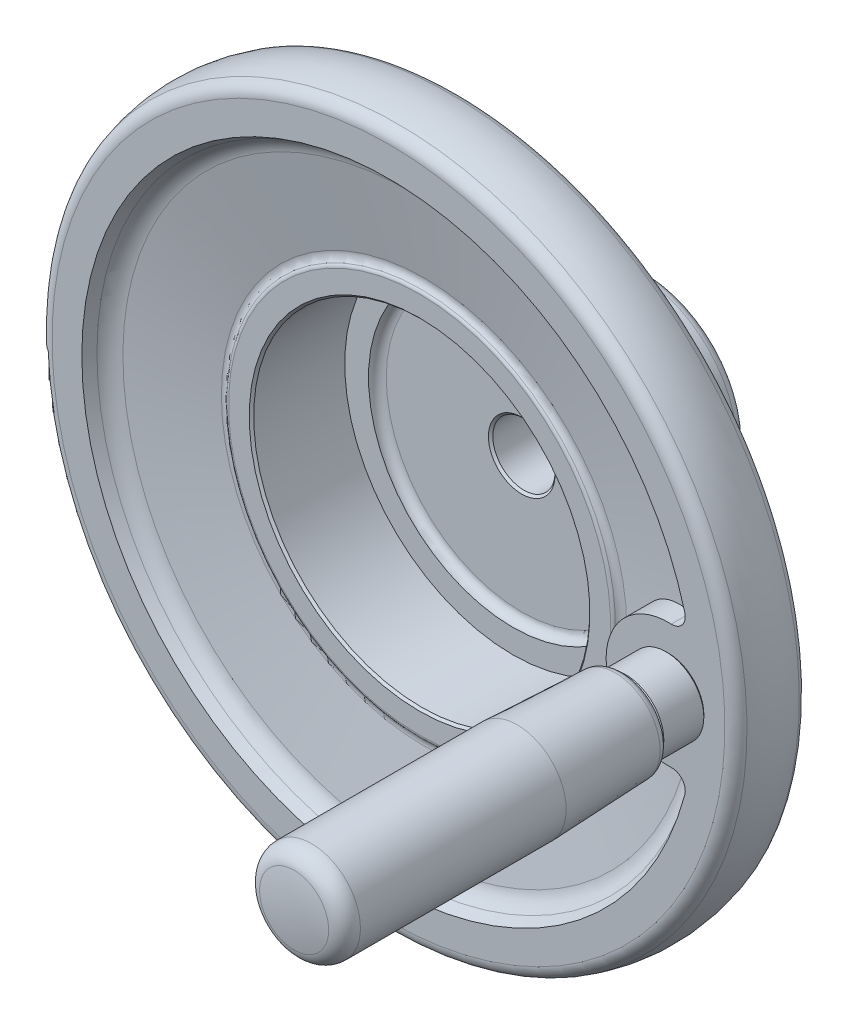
ISO-10303-21;
HEADER;
FILE_DESCRIPTION(('STEP AP214'),'2;1');
FILE_NAME('part.step','',(''),(''),'','','');
FILE_SCHEMA(('AUTOMOTIVE_DESIGN { 1 0 10303 214 1 1 1 1 }'));
ENDSEC;
DATA;
#1=APPLICATION_CONTEXT('core data for automotive mechanical design processes');
#2=APPLICATION_PROTOCOL_DEFINITION('international standard','automotive_design',2000,#1);
#3=PRODUCT_CONTEXT('',#1,'mechanical');
#4=PRODUCT('Part','Part','',(#3));
#5=PRODUCT_RELATED_PRODUCT_CATEGORY('part','',(#4));
#6=PRODUCT_DEFINITION_FORMATION('','',#4);
#7=PRODUCT_DEFINITION_CONTEXT('part definition',#1,'design');
#8=PRODUCT_DEFINITION('design','',#6,#7);
#9=PRODUCT_DEFINITION_SHAPE('','',#8);
#10=(LENGTH_UNIT() NAMED_UNIT(*) SI_UNIT(.MILLI.,.METRE.));
#11=(NAMED_UNIT(*) PLANE_ANGLE_UNIT() SI_UNIT($,.RADIAN.));
#12=(NAMED_UNIT(*) SI_UNIT($,.STERADIAN.) SOLID_ANGLE_UNIT());
#13=UNCERTAINTY_MEASURE_WITH_UNIT(LENGTH_MEASURE(1.E-05),#10,'distance_accuracy_value','');
#14=(GEOMETRIC_REPRESENTATION_CONTEXT(3) GLOBAL_UNCERTAINTY_ASSIGNED_CONTEXT((#13)) GLOBAL_UNIT_ASSIGNED_CONTEXT((#10,
#11,#12)) REPRESENTATION_CONTEXT('',''));
#15=CARTESIAN_POINT('',(0.,0.,0.));
#16=DIRECTION('',(0.,0.,1.));
#17=DIRECTION('',(1.,0.,0.));
#18=AXIS2_PLACEMENT_3D('',#15,#16,#17);
#19=CARTESIAN_POINT('',(0.,0.,151.744818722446));
#20=DIRECTION('',(0.,0.,1.));
#21=DIRECTION('',(0.,-1.,0.));
#22=AXIS2_PLACEMENT_3D('',#19,#20,#21);
#23=CYLINDRICAL_SURFACE('',#22,37.85);
#24=CARTESIAN_POINT('',(0.,0.,50.4999999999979));
#25=DIRECTION('',(0.,0.,1.));
#26=DIRECTION('',(0.,-1.,0.));
#27=AXIS2_PLACEMENT_3D('',#24,#25,#26);
#28=CIRCLE('',#27,37.85);
#29=CARTESIAN_POINT('',(0.,-37.85,50.4999999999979));
#30=VERTEX_POINT('',#29);
#31=EDGE_CURVE('E22',#30,#30,#28,.T.);
#32=ORIENTED_EDGE('',*,*,#31,.T.);
#33=EDGE_LOOP('',(#32));
#34=FACE_BOUND('',#33,.T.);
#35=CARTESIAN_POINT('',(0.,37.85,37.5));
#36=CARTESIAN_POINT('',(-0.140262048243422,37.8499989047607,37.5000061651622));
#37=CARTESIAN_POINT('',(-0.280621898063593,37.8492120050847,37.5118437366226));
#38=CARTESIAN_POINT('',(-0.557464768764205,37.8461485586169,37.5588955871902));
#39=CARTESIAN_POINT('',(-0.693943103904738,37.8438702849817,37.5941369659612));
#40=CARTESIAN_POINT('',(-0.958972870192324,37.8380817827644,37.6869787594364));
#41=CARTESIAN_POINT('',(-1.08752848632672,37.8345722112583,37.7445672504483));
#42=CARTESIAN_POINT('',(-1.33311529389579,37.8267156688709,37.8804488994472));
#43=CARTESIAN_POINT('',(-1.45014909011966,37.8223688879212,37.95873736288));
#44=CARTESIAN_POINT('',(-1.6695970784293,37.8133183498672,38.1339382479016));
#45=CARTESIAN_POINT('',(-1.77198964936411,37.8086140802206,38.2308777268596));
#46=CARTESIAN_POINT('',(-1.95906361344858,37.7993831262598,38.4405728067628));
#47=CARTESIAN_POINT('',(-2.04374426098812,37.7948564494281,38.5533290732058));
#48=CARTESIAN_POINT('',(-2.1930586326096,37.7864871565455,38.791581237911));
#49=CARTESIAN_POINT('',(-2.25767417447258,37.7826451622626,38.9170885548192));
#50=CARTESIAN_POINT('',(-2.36490784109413,37.7760852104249,39.1772001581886));
#51=CARTESIAN_POINT('',(-2.40752622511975,37.773367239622,39.3118043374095));
#52=CARTESIAN_POINT('',(-2.46949520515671,37.7693667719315,39.5860786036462));
#53=CARTESIAN_POINT('',(-2.48887997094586,37.7680821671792,39.7257409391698));
#54=CARTESIAN_POINT('',(-2.50393694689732,37.7670869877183,40.0063426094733));
#55=CARTESIAN_POINT('',(-2.49960945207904,37.7673763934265,40.1472819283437));
#56=CARTESIAN_POINT('',(-2.46739308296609,37.7694946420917,40.4262037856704));
#57=CARTESIAN_POINT('',(-2.43954120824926,37.7713210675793,40.5641906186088));
#58=CARTESIAN_POINT('',(-2.36112409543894,37.7763037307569,40.8335263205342));
#59=CARTESIAN_POINT('',(-2.31055870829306,37.7794599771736,40.9648751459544));
#60=CARTESIAN_POINT('',(-2.18810801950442,37.7867493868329,41.2173250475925));
#61=CARTESIAN_POINT('',(-2.11620596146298,37.7908833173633,41.3384179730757));
#62=CARTESIAN_POINT('',(-1.95313509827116,37.7996614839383,41.566829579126));
#63=CARTESIAN_POINT('',(-1.86196605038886,37.8043057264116,41.6741480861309));
#64=CARTESIAN_POINT('',(-1.66274090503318,37.813591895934,41.872179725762));
#65=CARTESIAN_POINT('',(-1.55465279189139,37.8182338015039,41.962860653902));
#66=CARTESIAN_POINT('',(-1.32476989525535,37.8269836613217,42.1247945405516));
#67=CARTESIAN_POINT('',(-1.20297510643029,37.8310916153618,42.1960474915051));
#68=CARTESIAN_POINT('',(-0.949116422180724,37.8383110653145,42.3171001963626));
#69=CARTESIAN_POINT('',(-0.817051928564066,37.8414225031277,42.3668986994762));
#70=CARTESIAN_POINT('',(-0.546411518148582,37.8462975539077,42.4436072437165));
#71=CARTESIAN_POINT('',(-0.407835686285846,37.8480611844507,42.4705175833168));
#72=CARTESIAN_POINT('',(-0.128385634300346,37.8500396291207,42.5006459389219));
#73=CARTESIAN_POINT('',(0.0124837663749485,37.8502573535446,42.5039084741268));
#74=CARTESIAN_POINT('',(0.292767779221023,37.8491271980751,42.4867649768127));
#75=CARTESIAN_POINT('',(0.432182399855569,37.8477793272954,42.4663590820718));
#76=CARTESIAN_POINT('',(0.705473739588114,37.8436715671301,42.4024948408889));
#77=CARTESIAN_POINT('',(0.839355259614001,37.8409129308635,42.3590569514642));
#78=CARTESIAN_POINT('',(1.09792825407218,37.8342939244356,42.2503825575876));
#79=CARTESIAN_POINT('',(1.22261963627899,37.8304335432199,42.185145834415));
#80=CARTESIAN_POINT('',(1.45947650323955,37.8220374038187,42.0346124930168));
#81=CARTESIAN_POINT('',(1.57162307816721,37.8175006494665,41.9492861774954));
#82=CARTESIAN_POINT('',(1.78001646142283,37.8082655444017,41.7610389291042));
#83=CARTESIAN_POINT('',(1.87626309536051,37.8035671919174,41.65811780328));
#84=CARTESIAN_POINT('',(2.05027560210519,37.7945299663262,41.4374102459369));
#85=CARTESIAN_POINT('',(2.12801256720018,37.7901916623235,41.319600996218));
#86=CARTESIAN_POINT('',(2.26260126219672,37.782372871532,41.0725758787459));
#87=CARTESIAN_POINT('',(2.3194531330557,37.7788923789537,40.9433600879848));
#88=CARTESIAN_POINT('',(2.410607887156,37.7731858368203,40.6772949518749));
#89=CARTESIAN_POINT('',(2.44492888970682,37.7709587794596,40.5404518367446));
#90=CARTESIAN_POINT('',(2.49010680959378,37.7680074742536,40.2629301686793));
#91=CARTESIAN_POINT('',(2.50096399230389,37.7672832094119,40.1222516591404));
#92=CARTESIAN_POINT('',(2.49890345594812,37.7674195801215,39.8413399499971));
#93=CARTESIAN_POINT('',(2.48603117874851,37.7682771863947,39.7011064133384));
#94=CARTESIAN_POINT('',(2.436971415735,37.7714742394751,39.424796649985));
#95=CARTESIAN_POINT('',(2.40078388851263,37.773813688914,39.2887204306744));
#96=CARTESIAN_POINT('',(2.30613130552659,37.7797100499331,39.0245818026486));
#97=CARTESIAN_POINT('',(2.24766654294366,37.783266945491,38.8965192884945));
#98=CARTESIAN_POINT('',(2.11012507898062,37.7911973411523,38.6520215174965));
#99=CARTESIAN_POINT('',(2.03104887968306,37.7955708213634,38.5355859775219));
#100=CARTESIAN_POINT('',(1.8543604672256,37.8046513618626,38.3174163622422));
#101=CARTESIAN_POINT('',(1.75671521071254,37.8093590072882,38.2157090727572));
#102=CARTESIAN_POINT('',(1.54570851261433,37.8185723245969,38.0300936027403));
#103=CARTESIAN_POINT('',(1.43234323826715,37.8230779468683,37.9461897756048));
#104=CARTESIAN_POINT('',(1.19297226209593,37.8313847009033,37.7984937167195));
#105=CARTESIAN_POINT('',(1.06694995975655,37.835184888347,37.73472836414));
#106=CARTESIAN_POINT('',(0.806053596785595,37.8416402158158,37.6293404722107));
#107=CARTESIAN_POINT('',(0.671190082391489,37.8442966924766,37.5876920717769));
#108=CARTESIAN_POINT('',(0.446254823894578,37.8474712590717,37.5385124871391));
#109=CARTESIAN_POINT('',(0.357636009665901,37.8484153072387,37.5240890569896));
#110=CARTESIAN_POINT('',(0.179358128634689,37.8496800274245,37.504830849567));
#111=CARTESIAN_POINT('',(0.089699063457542,37.8500007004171,37.4999960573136));
#112=CARTESIAN_POINT('',(0.,37.85,37.5));
#113=B_SPLINE_CURVE_WITH_KNOTS('',3,(#35,#36,#37,#38,#39,#40,#41,#42,#43,#44,#45,#46,#47,#48,
#49,#50,#51,#52,#53,#54,#55,#56,#57,#58,#59,#60,#61,#62,#63,#64,#65,#66,#67,#68,#69,#70,#71,#72,
#73,#74,#75,#76,#77,#78,#79,#80,#81,#82,#83,#84,#85,#86,#87,#88,#89,#90,#91,#92,#93,#94,#95,#96,
#97,#98,#99,#100,#101,#102,#103,#104,#105,#106,#107,#108,#109,#110,#111,#112),.UNSPECIFIED.,.T.,
.F.,(4,2,2,2,2,2,2,2,2,2,2,2,2,2,2,2,2,2,2,2,2,2,2,2,2,2,2,2,2,2,2,2,2,2,2,2,2,2,4),(0.,
0.420458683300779,0.841405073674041,1.26212716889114,1.68275393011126,2.10399556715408,
2.5252549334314,2.94689492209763,3.36852994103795,3.78954409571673,4.21055301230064,
4.63090098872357,5.05125172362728,5.47193345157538,5.89262047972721,6.31411341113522,
6.73560650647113,7.15712417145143,7.57863633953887,7.99935476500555,8.42007074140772,
8.84041366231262,9.26076080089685,9.68173325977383,10.1027103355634,10.5243406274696,
10.9459680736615,11.3672560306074,11.7885392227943,12.2090164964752,12.6294945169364,
13.0499670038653,13.470429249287,13.891646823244,14.312967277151,14.7348477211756,
15.1562337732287,15.4251219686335,15.6940097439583),.UNSPECIFIED.);
#114=CARTESIAN_POINT('',(0.,37.85,37.5));
#115=VERTEX_POINT('',#114);
#116=EDGE_CURVE('E357',#115,#115,#113,.T.);
#117=ORIENTED_EDGE('',*,*,#116,.T.);
#118=EDGE_LOOP('',(#117));
#119=FACE_BOUND('',#118,.T.);
#120=CARTESIAN_POINT('',(0.,0.,30.));
#121=DIRECTION('',(0.,0.,1.));
#122=DIRECTION('',(0.,-1.,0.));
#123=AXIS2_PLACEMENT_3D('',#120,#121,#122);
#124=CIRCLE('',#123,37.85);
#125=CARTESIAN_POINT('',(0.,-37.85,30.));
#126=VERTEX_POINT('',#125);
#127=EDGE_CURVE('E410',#126,#126,#124,.T.);
#128=ORIENTED_EDGE('',*,*,#127,.F.);
#129=EDGE_LOOP('',(#128));
#130=FACE_BOUND('',#129,.T.);
#131=ADVANCED_FACE('F14',(#34,#119,#130),#23,.F.);
#132=CARTESIAN_POINT('',(0.,44.,40.));
#133=DIRECTION('',(0.,-1.,0.));
#134=DIRECTION('',(0.,0.,-1.));
#135=AXIS2_PLACEMENT_3D('',#132,#133,#134);
#136=CYLINDRICAL_SURFACE('',#135,2.49999999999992);
#137=DIRECTION('',(0.,-1.,0.));
#138=VECTOR('',#137,1.);
#139=CARTESIAN_POINT('',(1.5,44.,42.));
#140=LINE('',#139,#138);
#141=CARTESIAN_POINT('',(1.5,44.,42.));
#142=VERTEX_POINT('',#141);
#143=CARTESIAN_POINT('',(1.5,43.8787668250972,42.));
#144=VERTEX_POINT('',#143);
#145=EDGE_CURVE('E224',#142,#144,#140,.T.);
#146=ORIENTED_EDGE('',*,*,#145,.T.);
#147=CARTESIAN_POINT('',(2.04528238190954,43.7870215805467,41.437643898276));
#148=CARTESIAN_POINT('',(2.00727575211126,43.7916286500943,41.4917233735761));
#149=CARTESIAN_POINT('',(1.967168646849,43.7973085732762,41.544215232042));
#150=CARTESIAN_POINT('',(1.8833154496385,43.8103158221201,41.6454199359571));
#151=CARTESIAN_POINT('',(1.83959437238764,43.8176323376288,41.6941548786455));
#152=CARTESIAN_POINT('',(1.74858301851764,43.8334847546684,41.7879397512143));
#153=CARTESIAN_POINT('',(1.70129301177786,43.8420205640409,41.8329899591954));
#154=CARTESIAN_POINT('',(1.60310285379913,43.8599192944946,41.9194716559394));
#155=CARTESIAN_POINT('',(1.552181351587,43.8692872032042,41.9608778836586));
#156=CARTESIAN_POINT('',(1.49973329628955,43.8788152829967,42.0002));
#157=B_SPLINE_CURVE_WITH_KNOTS('',3,(#147,#148,#149,#150,#151,#152,#153,#154,#155,#156),
.UNSPECIFIED.,.F.,.F.,(4,2,2,2,4),(0.,0.198694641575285,0.396113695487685,0.59351783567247,
0.792197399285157),.UNSPECIFIED.);
#158=CARTESIAN_POINT('',(2.04514178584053,43.787038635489,41.437843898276));
#159=VERTEX_POINT('',#158);
#160=EDGE_CURVE('E276',#159,#144,#157,.T.);
#161=ORIENTED_EDGE('',*,*,#160,.F.);
#162=CARTESIAN_POINT('',(2.04500116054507,43.7870556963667,41.438043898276));
#163=CARTESIAN_POINT('',(2.08551346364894,43.7821411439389,41.3804437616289));
#164=CARTESIAN_POINT('',(2.12357820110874,43.7771951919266,41.3211290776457));
#165=CARTESIAN_POINT('',(2.19457074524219,43.7673118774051,41.1995037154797));
#166=CARTESIAN_POINT('',(2.22749875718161,43.7623745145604,41.1371931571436));
#167=CARTESIAN_POINT('',(2.28796170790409,43.7525822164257,41.0100415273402));
#168=CARTESIAN_POINT('',(2.31549977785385,43.7477272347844,40.9452019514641));
#169=CARTESIAN_POINT('',(2.36500991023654,43.7381631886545,40.813442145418));
#170=CARTESIAN_POINT('',(2.38698204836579,43.7334541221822,40.7465219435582));
#171=CARTESIAN_POINT('',(2.44430918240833,43.7196320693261,40.5432593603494));
#172=CARTESIAN_POINT('',(2.47109785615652,43.710820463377,40.4043666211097));
#173=CARTESIAN_POINT('',(2.50089711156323,43.6944128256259,40.1240896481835));
#174=CARTESIAN_POINT('',(2.50391333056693,43.6868165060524,39.9827060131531));
#175=CARTESIAN_POINT('',(2.48611122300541,43.6730778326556,39.7016120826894));
#176=CARTESIAN_POINT('',(2.46533582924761,43.6669328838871,39.5618992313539));
#177=CARTESIAN_POINT('',(2.40056615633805,43.6561589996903,39.2878843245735));
#178=CARTESIAN_POINT('',(2.35656853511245,43.651530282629,39.153583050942));
#179=CARTESIAN_POINT('',(2.24673800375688,43.6437300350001,38.8946052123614));
#180=CARTESIAN_POINT('',(2.18096361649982,43.6405546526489,38.7699039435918));
#181=CARTESIAN_POINT('',(2.02941340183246,43.6354507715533,38.5332969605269));
#182=CARTESIAN_POINT('',(1.94363890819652,43.6335221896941,38.4213903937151));
#183=CARTESIAN_POINT('',(1.75457453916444,43.6306349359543,38.2136107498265));
#184=CARTESIAN_POINT('',(1.65129465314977,43.6296757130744,38.1177285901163));
#185=CARTESIAN_POINT('',(1.43011193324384,43.6284091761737,37.944640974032));
#186=CARTESIAN_POINT('',(1.31220875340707,43.6281018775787,37.8674359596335));
#187=CARTESIAN_POINT('',(1.06504802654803,43.6278320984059,37.7338539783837));
#188=CARTESIAN_POINT('',(0.935783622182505,43.6278698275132,37.6774896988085));
#189=CARTESIAN_POINT('',(0.669629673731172,43.6280366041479,37.5872544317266));
#190=CARTESIAN_POINT('',(0.532740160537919,43.6281656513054,37.5533833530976));
#191=CARTESIAN_POINT('',(0.255168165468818,43.6283504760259,37.5090868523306));
#192=CARTESIAN_POINT('',(0.114484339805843,43.6284062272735,37.498669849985));
#193=CARTESIAN_POINT('',(-0.166635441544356,43.6283918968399,37.5016021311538));
#194=CARTESIAN_POINT('',(-0.30707139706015,43.6283218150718,37.5149514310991));
#195=CARTESIAN_POINT('',(-0.583709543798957,43.6281229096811,37.5650374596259));
#196=CARTESIAN_POINT('',(-0.719911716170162,43.627994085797,37.6017742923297));
#197=CARTESIAN_POINT('',(-0.984216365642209,43.6278551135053,37.6975930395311));
#198=CARTESIAN_POINT('',(-1.1123187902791,43.6278449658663,37.7566750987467));
#199=CARTESIAN_POINT('',(-1.3567868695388,43.6282064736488,37.8955073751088));
#200=CARTESIAN_POINT('',(-1.47315246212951,43.628578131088,37.9752577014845));
#201=CARTESIAN_POINT('',(-1.69083851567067,43.6300148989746,38.1531585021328));
#202=CARTESIAN_POINT('',(-1.7921593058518,43.6310799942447,38.251308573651));
#203=CARTESIAN_POINT('',(-1.97684475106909,43.6342177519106,38.463176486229));
#204=CARTESIAN_POINT('',(-2.06021613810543,43.6362900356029,38.5768884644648));
#205=CARTESIAN_POINT('',(-2.20668931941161,43.6417112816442,38.8166737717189));
#206=CARTESIAN_POINT('',(-2.26979012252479,43.6450603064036,38.9427477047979));
#207=CARTESIAN_POINT('',(-2.37390325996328,43.6532113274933,39.2035770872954));
#208=CARTESIAN_POINT('',(-2.41492860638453,43.6580124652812,39.3383273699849));
#209=CARTESIAN_POINT('',(-2.47380310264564,43.6691195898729,39.612719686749));
#210=CARTESIAN_POINT('',(-2.49165519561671,43.6754253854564,39.7523610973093));
#211=CARTESIAN_POINT('',(-2.50372161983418,43.6894499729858,40.032672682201));
#212=CARTESIAN_POINT('',(-2.4979222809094,43.6971695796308,40.173343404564));
#213=CARTESIAN_POINT('',(-2.46286000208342,43.7137691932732,40.4516679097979));
#214=CARTESIAN_POINT('',(-2.43359381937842,43.7226493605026,40.5893212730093));
#215=CARTESIAN_POINT('',(-2.35449394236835,43.7407070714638,40.850910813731));
#216=CARTESIAN_POINT('',(-2.30578683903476,43.749846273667,40.9751885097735));
#217=CARTESIAN_POINT('',(-2.2184509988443,43.7637423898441,41.1545192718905));
#218=CARTESIAN_POINT('',(-2.18694222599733,43.7684078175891,41.213140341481));
#219=CARTESIAN_POINT('',(-2.11935303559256,43.7777429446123,41.327690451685));
#220=CARTESIAN_POINT('',(-2.08327228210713,43.7824126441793,41.3836192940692));
#221=CARTESIAN_POINT('',(-2.04500116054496,43.7870556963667,41.438043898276));
#222=B_SPLINE_CURVE_WITH_KNOTS('',3,(#162,#163,#164,#165,#166,#167,#168,#169,#170,#171,#172,
#173,#174,#175,#176,#177,#178,#179,#180,#181,#182,#183,#184,#185,#186,#187,#188,#189,#190,#191,
#192,#193,#194,#195,#196,#197,#198,#199,#200,#201,#202,#203,#204,#205,#206,#207,#208,#209,#210,
#211,#212,#213,#214,#215,#216,#217,#218,#219,#220,#221),.UNSPECIFIED.,.F.,.F.,(4,2,2,2,2,2,2,2,
2,2,2,2,2,2,2,2,2,2,2,2,2,2,2,2,2,2,2,2,2,4),(0.,0.211706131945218,0.42340380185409,
0.634978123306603,0.846549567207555,1.26953343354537,1.69241699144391,2.11453864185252,
2.53672105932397,2.95777799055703,3.37880685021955,3.799596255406,4.22039561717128,
4.64145073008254,5.06250413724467,5.48370867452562,5.90491350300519,6.32612020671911,
6.74732963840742,7.16854129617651,7.58974373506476,8.01078792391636,8.4318526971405,
8.85266900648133,9.27343186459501,9.69443795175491,10.1155022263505,10.5150649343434,
10.7150287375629,10.9150072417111),.UNSPECIFIED.);
#223=CARTESIAN_POINT('',(-2.04514178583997,43.787038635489,41.437843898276));
#224=VERTEX_POINT('',#223);
#225=EDGE_CURVE('E247',#159,#224,#222,.T.);
#226=ORIENTED_EDGE('',*,*,#225,.T.);
#227=CARTESIAN_POINT('',(-1.4997332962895,43.8788152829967,42.0002));
#228=CARTESIAN_POINT('',(-1.55218135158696,43.8692872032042,41.9608778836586));
#229=CARTESIAN_POINT('',(-1.6031028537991,43.8599192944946,41.9194716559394));
#230=CARTESIAN_POINT('',(-1.70129301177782,43.8420205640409,41.8329899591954));
#231=CARTESIAN_POINT('',(-1.7485830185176,43.8334847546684,41.7879397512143));
#232=CARTESIAN_POINT('',(-1.8395943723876,43.8176323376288,41.6941548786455));
#233=CARTESIAN_POINT('',(-1.88331544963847,43.8103158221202,41.6454199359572));
#234=CARTESIAN_POINT('',(-1.96716864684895,43.7973085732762,41.544215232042));
#235=CARTESIAN_POINT('',(-2.0072757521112,43.7916286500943,41.4917233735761));
#236=CARTESIAN_POINT('',(-2.04528238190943,43.7870215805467,41.437643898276));
#237=B_SPLINE_CURVE_WITH_KNOTS('',3,(#227,#228,#229,#230,#231,#232,#233,#234,#235,#236),
.UNSPECIFIED.,.F.,.F.,(4,2,2,2,4),(0.,0.198679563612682,0.396083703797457,0.593502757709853,
0.792197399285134),.UNSPECIFIED.);
#238=CARTESIAN_POINT('',(-1.4999999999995,43.8787668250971,42.));
#239=VERTEX_POINT('',#238);
#240=EDGE_CURVE('E270',#239,#224,#237,.T.);
#241=ORIENTED_EDGE('',*,*,#240,.F.);
#242=DIRECTION('',(0.,-1.,0.));
#243=VECTOR('',#242,1.);
#244=CARTESIAN_POINT('',(-1.4999999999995,44.,42.));
#245=LINE('',#244,#243);
#246=CARTESIAN_POINT('',(-1.4999999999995,44.,42.));
#247=VERTEX_POINT('',#246);
#248=EDGE_CURVE('E282',#239,#247,#245,.F.);
#249=ORIENTED_EDGE('',*,*,#248,.T.);
#250=CARTESIAN_POINT('',(0.,44.,40.));
#251=DIRECTION('',(0.,-1.,0.));
#252=DIRECTION('',(0.,0.,-1.));
#253=AXIS2_PLACEMENT_3D('',#250,#251,#252);
#254=CIRCLE('',#253,2.49999999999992);
#255=EDGE_CURVE('E198',#142,#247,#254,.T.);
#256=ORIENTED_EDGE('',*,*,#255,.F.);
#257=EDGE_LOOP('',(#146,#161,#226,#241,#249,#256));
#258=FACE_BOUND('',#257,.T.);
#259=ORIENTED_EDGE('',*,*,#116,.F.);
#260=EDGE_LOOP('',(#259));
#261=FACE_BOUND('',#260,.T.);
#262=ADVANCED_FACE('F206',(#258,#261),#136,.F.);
#263=CARTESIAN_POINT('',(0.,0.,73.000000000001));
#264=DIRECTION('',(0.,0.,1.));
#265=DIRECTION('',(0.,-1.,0.));
#266=AXIS2_PLACEMENT_3D('',#263,#264,#265);
#267=CYLINDRICAL_SURFACE('',#266,22.4999999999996);
#268=CARTESIAN_POINT('',(0.,0.,2.));
#269=DIRECTION('',(0.,0.,1.));
#270=DIRECTION('',(0.,-1.,0.));
#271=AXIS2_PLACEMENT_3D('',#268,#269,#270);
#272=CIRCLE('',#271,22.4999999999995);
#273=CARTESIAN_POINT('',(0.,-22.4999999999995,2.));
#274=VERTEX_POINT('',#273);
#275=EDGE_CURVE('E784',#274,#274,#272,.T.);
#276=ORIENTED_EDGE('',*,*,#275,.T.);
#277=EDGE_LOOP('',(#276));
#278=FACE_BOUND('',#277,.T.);
#279=CARTESIAN_POINT('',(0.,0.,21.));
#280=DIRECTION('',(0.,0.,1.));
#281=DIRECTION('',(0.,-1.,0.));
#282=AXIS2_PLACEMENT_3D('',#279,#280,#281);
#283=CIRCLE('',#282,22.4999999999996);
#284=CARTESIAN_POINT('',(0.,-22.4999999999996,21.));
#285=VERTEX_POINT('',#284);
#286=EDGE_CURVE('E786',#285,#285,#283,.T.);
#287=ORIENTED_EDGE('',*,*,#286,.F.);
#288=EDGE_LOOP('',(#287));
#289=FACE_BOUND('',#288,.T.);
#290=CARTESIAN_POINT('',(0.,22.4999999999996,7.5));
#291=CARTESIAN_POINT('',(0.1399632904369,22.499998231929,7.50000601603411));
#292=CARTESIAN_POINT('',(0.280017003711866,22.4986801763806,7.51179343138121));
#293=CARTESIAN_POINT('',(0.556235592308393,22.493548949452,7.55863441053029));
#294=CARTESIAN_POINT('',(0.692396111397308,22.4897330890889,7.59371304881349));
#295=CARTESIAN_POINT('',(0.956788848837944,22.4800366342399,7.68609744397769));
#296=CARTESIAN_POINT('',(1.08502602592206,22.474157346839,7.7433891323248));
#297=CARTESIAN_POINT('',(1.33003816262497,22.4609899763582,7.87854451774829));
#298=CARTESIAN_POINT('',(1.44681526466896,22.4537021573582,7.95640435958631));
#299=CARTESIAN_POINT('',(1.66613219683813,22.4384971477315,8.13085256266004));
#300=CARTESIAN_POINT('',(1.76861447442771,22.4305776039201,8.22751308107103));
#301=CARTESIAN_POINT('',(1.95593754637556,22.4150209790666,8.43666434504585));
#302=CARTESIAN_POINT('',(2.0407774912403,22.4073839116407,8.54915585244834));
#303=CARTESIAN_POINT('',(2.19061627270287,22.3932333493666,8.78714241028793));
#304=CARTESIAN_POINT('',(2.25556219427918,22.3867228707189,8.91267097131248));
#305=CARTESIAN_POINT('',(2.36343147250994,22.3755927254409,9.17293682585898));
#306=CARTESIAN_POINT('',(2.4063554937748,22.3709730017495,9.30767384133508));
#307=CARTESIAN_POINT('',(2.46878993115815,22.3641693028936,9.58193999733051));
#308=CARTESIAN_POINT('',(2.48839662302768,22.3619753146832,9.72144696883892));
#309=CARTESIAN_POINT('',(2.50393757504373,22.360240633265,10.0017873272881));
#310=CARTESIAN_POINT('',(2.499872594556,22.3606998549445,10.1426206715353));
#311=CARTESIAN_POINT('',(2.46826480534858,22.3642105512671,10.4209493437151));
#312=CARTESIAN_POINT('',(2.4408275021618,22.3672503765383,10.5584568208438));
#313=CARTESIAN_POINT('',(2.36341826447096,22.3755615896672,10.8269032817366));
#314=CARTESIAN_POINT('',(2.31344596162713,22.3808330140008,10.9578421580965));
#315=CARTESIAN_POINT('',(2.19227007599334,22.3930268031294,11.2097655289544));
#316=CARTESIAN_POINT('',(2.12102008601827,22.3999527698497,11.33072752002));
#317=CARTESIAN_POINT('',(1.95934463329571,22.4146723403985,11.5590170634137));
#318=CARTESIAN_POINT('',(1.86891847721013,22.4224659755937,11.6663441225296));
#319=CARTESIAN_POINT('',(1.67087018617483,22.4380946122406,11.8649299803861));
#320=CARTESIAN_POINT('',(1.56315700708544,22.4459296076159,11.9560980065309));
#321=CARTESIAN_POINT('',(1.33390727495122,22.4607182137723,12.1190729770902));
#322=CARTESIAN_POINT('',(1.21237070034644,22.4676718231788,12.1908798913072));
#323=CARTESIAN_POINT('',(0.958858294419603,22.4799172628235,12.3130922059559));
#324=CARTESIAN_POINT('',(0.82688000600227,22.4852087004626,12.3634925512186));
#325=CARTESIAN_POINT('',(0.556262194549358,22.4935298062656,12.4413922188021));
#326=CARTESIAN_POINT('',(0.417622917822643,22.4965595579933,12.4688923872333));
#327=CARTESIAN_POINT('',(0.138404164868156,22.5000051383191,12.5000948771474));
#328=CARTESIAN_POINT('',(-0.00216116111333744,22.5004347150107,12.5039223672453));
#329=CARTESIAN_POINT('',(-0.281931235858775,22.4986685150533,12.4880002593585));
#330=CARTESIAN_POINT('',(-0.421136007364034,22.4964727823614,12.4682510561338));
#331=CARTESIAN_POINT('',(-0.693868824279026,22.4897113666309,12.4058400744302));
#332=CARTESIAN_POINT('',(-0.827410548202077,22.4851517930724,12.3632373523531));
#333=CARTESIAN_POINT('',(-1.08545283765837,22.47417375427,12.2563896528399));
#334=CARTESIAN_POINT('',(-1.20995315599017,22.4677552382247,12.1921440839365));
#335=CARTESIAN_POINT('',(-1.44694158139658,22.453741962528,12.0435271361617));
#336=CARTESIAN_POINT('',(-1.55937816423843,22.4461424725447,11.9590740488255));
#337=CARTESIAN_POINT('',(-1.76852479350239,22.4306339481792,11.7725558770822));
#338=CARTESIAN_POINT('',(-1.86523435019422,22.422724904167,11.6704902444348));
#339=CARTESIAN_POINT('',(-2.04062028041,22.4074468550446,11.4510958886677));
#340=CARTESIAN_POINT('',(-2.11921415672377,22.4000804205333,11.3337010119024));
#341=CARTESIAN_POINT('',(-2.25556945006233,22.3867621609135,11.0873046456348));
#342=CARTESIAN_POINT('',(-2.31333120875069,22.3808103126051,10.9583033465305));
#343=CARTESIAN_POINT('',(-2.40624640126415,22.3710118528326,10.6926319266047));
#344=CARTESIAN_POINT('',(-2.44144784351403,22.367160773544,10.555978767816));
#345=CARTESIAN_POINT('',(-2.48839847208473,22.3619864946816,10.2786560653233));
#346=CARTESIAN_POINT('',(-2.5001485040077,22.3606632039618,10.137986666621));
#347=CARTESIAN_POINT('',(-2.49984946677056,22.3606965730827,9.85744480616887));
#348=CARTESIAN_POINT('',(-2.4879299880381,22.3620386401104,9.71757218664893));
#349=CARTESIAN_POINT('',(-2.44090312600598,22.3672202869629,9.44183032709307));
#350=CARTESIAN_POINT('',(-2.40579572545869,22.3710598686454,9.30596109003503));
#351=CARTESIAN_POINT('',(-2.31342739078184,22.3807996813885,9.04209061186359));
#352=CARTESIAN_POINT('',(-2.25617129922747,22.3866994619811,8.9140876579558));
#353=CARTESIAN_POINT('',(-2.12114385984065,22.3998957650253,8.66948688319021));
#354=CARTESIAN_POINT('',(-2.04337247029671,22.4071922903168,8.55288908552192));
#355=CARTESIAN_POINT('',(-1.86903744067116,22.4224078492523,8.33374469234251));
#356=CARTESIAN_POINT('',(-1.77237713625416,22.4303299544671,8.23127520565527));
#357=CARTESIAN_POINT('',(-1.56320524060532,22.4458763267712,8.04395765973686));
#358=CARTESIAN_POINT('',(-1.45068988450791,22.4535005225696,7.95911379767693));
#359=CARTESIAN_POINT('',(-1.21261810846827,22.4676169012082,7.80924458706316));
#360=CARTESIAN_POINT('',(-1.08702305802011,22.4741055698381,7.74428031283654));
#361=CARTESIAN_POINT('',(-0.826710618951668,22.4851829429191,7.63645313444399));
#362=CARTESIAN_POINT('',(-0.6920035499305,22.489773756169,7.59356568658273));
#363=CARTESIAN_POINT('',(-0.46380029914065,22.4954040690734,7.5416260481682));
#364=CARTESIAN_POINT('',(-0.371755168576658,22.4971193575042,7.52603806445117));
#365=CARTESIAN_POINT('',(-0.186486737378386,22.4994179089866,7.50522306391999));
#366=CARTESIAN_POINT('',(-0.0932634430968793,22.5000011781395,7.49999599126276));
#367=CARTESIAN_POINT('',(0.,22.4999999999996,7.5));
#368=B_SPLINE_CURVE_WITH_KNOTS('',3,(#290,#291,#292,#293,#294,#295,#296,#297,#298,#299,#300,
#301,#302,#303,#304,#305,#306,#307,#308,#309,#310,#311,#312,#313,#314,#315,#316,#317,#318,#319,
#320,#321,#322,#323,#324,#325,#326,#327,#328,#329,#330,#331,#332,#333,#334,#335,#336,#337,#338,
#339,#340,#341,#342,#343,#344,#345,#346,#347,#348,#349,#350,#351,#352,#353,#354,#355,#356,#357,
#358,#359,#360,#361,#362,#363,#364,#365,#366,#367),.UNSPECIFIED.,.T.,.F.,(4,2,2,2,2,2,2,2,2,2,2,
2,2,2,2,2,2,2,2,2,2,2,2,2,2,2,2,2,2,2,2,2,2,2,2,2,2,2,4),(0.,0.419549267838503,0.83955094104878,
1.25928704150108,1.67894452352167,2.10024562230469,2.52156700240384,2.94399949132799,
3.36641923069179,3.78708870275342,4.20774468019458,4.6265117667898,5.04528569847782,
5.46497974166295,5.88468896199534,6.3066859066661,6.72868350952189,7.15078071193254,
7.57286231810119,7.99271025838,8.41255116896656,8.83131234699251,9.25008497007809,
9.6705803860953,10.0910888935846,10.513476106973,10.9358563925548,11.3573348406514,
11.7787980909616,12.1979601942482,12.6171226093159,13.0361934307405,13.4552651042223,
13.8765403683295,14.2979158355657,14.7205731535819,15.1427595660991,15.4223244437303,
15.7018878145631),.UNSPECIFIED.);
#369=CARTESIAN_POINT('',(0.,22.4999999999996,7.5));
#370=VERTEX_POINT('',#369);
#371=EDGE_CURVE('E214',#370,#370,#368,.T.);
#372=ORIENTED_EDGE('',*,*,#371,.T.);
#373=EDGE_LOOP('',(#372));
#374=FACE_BOUND('',#373,.T.);
#375=CARTESIAN_POINT('',(-22.3606797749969,-2.500000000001,10.));
#376=CARTESIAN_POINT('',(-22.3606815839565,-2.499993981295,10.1399602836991));
#377=CARTESIAN_POINT('',(-22.3620080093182,-2.48820705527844,10.2800109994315));
#378=CARTESIAN_POINT('',(-22.367169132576,-2.44136819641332,10.5562233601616));
#379=CARTESIAN_POINT('',(-22.3710065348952,-2.40629117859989,10.6923806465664));
#380=CARTESIAN_POINT('',(-22.3807497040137,-2.31391152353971,10.9567665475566));
#381=CARTESIAN_POINT('',(-22.3866541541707,-2.25662303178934,11.0850001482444));
#382=CARTESIAN_POINT('',(-22.3998645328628,-2.12147517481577,11.3300062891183));
#383=CARTESIAN_POINT('',(-22.4071701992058,-2.04361965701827,11.4467809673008));
#384=CARTESIAN_POINT('',(-22.4223962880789,-1.86917582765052,11.6661006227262));
#385=CARTESIAN_POINT('',(-22.4303190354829,-1.77251439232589,11.7685872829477));
#386=CARTESIAN_POINT('',(-22.4458655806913,-1.56335945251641,11.9559188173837));
#387=CARTESIAN_POINT('',(-22.4534893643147,-1.45086519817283,12.0407628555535));
#388=CARTESIAN_POINT('',(-22.4676023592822,-1.21287621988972,12.1906059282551));
#389=CARTESIAN_POINT('',(-22.4740885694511,-1.08734845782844,12.2555527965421));
#390=CARTESIAN_POINT('',(-22.4851701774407,-0.827084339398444,12.3634240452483));
#391=CARTESIAN_POINT('',(-22.4897656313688,-0.692348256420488,12.4063490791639));
#392=CARTESIAN_POINT('',(-22.4965315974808,-0.418085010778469,12.468785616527));
#393=CARTESIAN_POINT('',(-22.4987120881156,-0.278580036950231,12.4883934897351));
#394=CARTESIAN_POINT('',(-22.5004364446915,0.00175640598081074,12.5039374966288));
#395=CARTESIAN_POINT('',(-22.4999803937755,0.142587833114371,12.499874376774));
#396=CARTESIAN_POINT('',(-22.4964911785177,0.420924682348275,12.468269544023));
#397=CARTESIAN_POINT('',(-22.4934693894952,0.558442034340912,12.4408314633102));
#398=CARTESIAN_POINT('',(-22.4852011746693,0.826907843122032,12.3634172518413));
#399=CARTESIAN_POINT('',(-22.479954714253,0.957856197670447,12.3134407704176));
#400=CARTESIAN_POINT('',(-22.4678072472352,1.20979109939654,12.1922562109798));
#401=CARTESIAN_POINT('',(-22.4609027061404,1.33075561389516,12.1210026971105));
#402=CARTESIAN_POINT('',(-22.446212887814,1.55904871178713,11.9593197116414));
#403=CARTESIAN_POINT('',(-22.4384275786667,1.6663768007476,11.8688895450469));
#404=CARTESIAN_POINT('',(-22.4227992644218,1.86495816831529,11.6708383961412));
#405=CARTESIAN_POINT('',(-22.4149561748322,1.95612148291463,11.5631271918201));
#406=CARTESIAN_POINT('',(-22.4001380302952,2.11908788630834,11.3338830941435));
#407=CARTESIAN_POINT('',(-22.3931629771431,2.1908909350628,11.2123501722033));
#408=CARTESIAN_POINT('',(-22.3808703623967,2.31310046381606,10.9588387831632));
#409=CARTESIAN_POINT('',(-22.37555328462,2.36350069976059,10.8268572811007));
#410=CARTESIAN_POINT('',(-22.3671884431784,2.44139916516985,10.5562324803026));
#411=CARTESIAN_POINT('',(-22.3641405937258,2.4688982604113,10.417589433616));
#412=CARTESIAN_POINT('',(-22.360674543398,2.50009669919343,10.1383688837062));
#413=CARTESIAN_POINT('',(-22.3602424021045,2.50392221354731,9.99780564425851));
#414=CARTESIAN_POINT('',(-22.3620198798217,2.48799689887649,9.71804021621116));
#415=CARTESIAN_POINT('',(-22.3642294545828,2.46824646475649,9.57883800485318));
#416=CARTESIAN_POINT('',(-22.3710287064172,2.4058357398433,9.30611814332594));
#417=CARTESIAN_POINT('',(-22.3756121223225,2.36323570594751,9.17258653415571));
#418=CARTESIAN_POINT('',(-22.3866375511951,2.25639676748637,8.91456328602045));
#419=CARTESIAN_POINT('',(-22.3930796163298,2.19215725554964,8.79007190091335));
#420=CARTESIAN_POINT('',(-22.4071300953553,2.04354926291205,8.55308963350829));
#421=CARTESIAN_POINT('',(-22.4147432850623,1.95909753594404,8.44065124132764));
#422=CARTESIAN_POINT('',(-22.4302628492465,1.7725810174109,8.2315003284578));
#423=CARTESIAN_POINT('',(-22.4381692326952,1.67051568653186,8.13478828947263));
#424=CARTESIAN_POINT('',(-22.453426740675,1.45112026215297,7.95939689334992));
#425=CARTESIAN_POINT('',(-22.4607752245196,1.33372395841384,7.88080009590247));
#426=CARTESIAN_POINT('',(-22.474050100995,1.08732394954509,7.74443967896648));
#427=CARTESIAN_POINT('',(-22.4799765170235,0.958320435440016,7.68667571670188));
#428=CARTESIAN_POINT('',(-22.4897276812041,0.692650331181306,7.59375908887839));
#429=CARTESIAN_POINT('',(-22.4935569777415,0.5560010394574,7.5585574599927));
#430=CARTESIAN_POINT('',(-22.4987012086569,0.278686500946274,7.51160514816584));
#431=CARTESIAN_POINT('',(-22.5000162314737,0.138021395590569,7.49985364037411));
#432=CARTESIAN_POINT('',(-22.499983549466,-0.14252291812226,7.50014832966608));
#433=CARTESIAN_POINT('',(-22.4986501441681,-0.282402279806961,7.51206672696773));
#434=CARTESIAN_POINT('',(-22.4934987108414,-0.558157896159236,7.55909379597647));
#435=CARTESIAN_POINT('',(-22.489680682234,-0.694034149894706,7.59420247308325));
#436=CARTESIAN_POINT('',(-22.479987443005,-0.957918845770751,7.68657605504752));
#437=CARTESIAN_POINT('',(-22.4741126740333,-1.08592897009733,7.74383620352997));
#438=CARTESIAN_POINT('',(-22.4609589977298,-1.3305423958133,7.87887397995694));
#439=CARTESIAN_POINT('',(-22.4536800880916,-1.44714567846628,7.95665164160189));
#440=CARTESIAN_POINT('',(-22.4384853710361,-1.66628987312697,8.13099362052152));
#441=CARTESIAN_POINT('',(-22.4305664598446,-1.76875481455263,8.22765316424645));
#442=CARTESIAN_POINT('',(-22.4150100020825,-1.95606354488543,8.43682166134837));
#443=CARTESIAN_POINT('',(-22.4073725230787,-2.04090312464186,8.54933438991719));
#444=CARTESIAN_POINT('',(-22.3932185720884,-2.1907676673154,8.78740397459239));
#445=CARTESIAN_POINT('',(-22.3867056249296,-2.25573080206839,8.91299993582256));
#446=CARTESIAN_POINT('',(-22.3755797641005,-2.36355559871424,9.17331429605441));
#447=CARTESIAN_POINT('',(-22.3709647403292,-2.40644181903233,9.30802236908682));
#448=CARTESIAN_POINT('',(-22.3653031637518,-2.4583780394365,9.53622234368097));
#449=CARTESIAN_POINT('',(-22.3635777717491,-2.47396448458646,9.62826295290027));
#450=CARTESIAN_POINT('',(-22.3612654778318,-2.49477744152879,9.81352232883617));
#451=CARTESIAN_POINT('',(-22.3606785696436,-2.50000401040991,9.90674108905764));
#452=CARTESIAN_POINT('',(-22.3606797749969,-2.500000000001,10.));
#453=B_SPLINE_CURVE_WITH_KNOTS('',3,(#375,#376,#377,#378,#379,#380,#381,#382,#383,#384,#385,
#386,#387,#388,#389,#390,#391,#392,#393,#394,#395,#396,#397,#398,#399,#400,#401,#402,#403,#404,
#405,#406,#407,#408,#409,#410,#411,#412,#413,#414,#415,#416,#417,#418,#419,#420,#421,#422,#423,
#424,#425,#426,#427,#428,#429,#430,#431,#432,#433,#434,#435,#436,#437,#438,#439,#440,#441,#442,
#443,#444,#445,#446,#447,#448,#449,#450,#451,#452),.UNSPECIFIED.,.T.,.F.,(4,2,2,2,2,2,2,2,2,2,2,
2,2,2,2,2,2,2,2,2,2,2,2,2,2,2,2,2,2,2,2,2,2,2,2,2,2,2,4),(0.,0.419540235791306,
0.839533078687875,1.25925888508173,1.6789062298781,2.10021914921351,2.52155202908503,
2.9439802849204,3.36639600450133,3.78705974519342,4.2077102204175,4.62650540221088,
5.04530710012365,5.46500959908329,5.88472731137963,6.30671223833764,6.72869803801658,
7.15080686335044,7.57289973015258,7.99274105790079,8.41257535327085,8.83130790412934,
9.25005220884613,9.67055177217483,10.0910642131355,10.5134568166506,10.935842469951,
11.3573083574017,11.778759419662,12.1979411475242,12.61712297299,13.0362148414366,
13.4553073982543,13.8765708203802,14.2979347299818,14.7205963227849,15.142786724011,
15.4223380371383,15.7018878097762),.UNSPECIFIED.);
#454=CARTESIAN_POINT('',(-22.3606797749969,-2.500000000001,10.));
#455=VERTEX_POINT('',#454);
#456=EDGE_CURVE('E191',#455,#455,#453,.T.);
#457=ORIENTED_EDGE('',*,*,#456,.F.);
#458=EDGE_LOOP('',(#457));
#459=FACE_BOUND('',#458,.T.);
#460=ADVANCED_FACE('F200',(#278,#289,#374,#459),#267,.T.);
#461=CARTESIAN_POINT('',(0.,0.,73.000000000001));
#462=DIRECTION('',(0.,0.,1.));
#463=DIRECTION('',(0.,-1.,0.));
#464=AXIS2_PLACEMENT_3D('',#461,#462,#463);
#465=CYLINDRICAL_SURFACE('',#464,7.);
#466=CARTESIAN_POINT('',(0.,0.,0.50000000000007));
#467=DIRECTION('',(0.,0.,1.));
#468=DIRECTION('',(0.,-1.,0.));
#469=AXIS2_PLACEMENT_3D('',#466,#467,#468);
#470=CIRCLE('',#469,7.);
#471=CARTESIAN_POINT('',(0.,-7.,0.50000000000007));
#472=VERTEX_POINT('',#471);
#473=EDGE_CURVE('E371',#472,#472,#470,.F.);
#474=ORIENTED_EDGE('',*,*,#473,.T.);
#475=EDGE_LOOP('',(#474));
#476=FACE_BOUND('',#475,.T.);
#477=CARTESIAN_POINT('',(0.,0.,27.5));
#478=DIRECTION('',(0.,0.,1.));
#479=DIRECTION('',(0.,-1.,0.));
#480=AXIS2_PLACEMENT_3D('',#477,#478,#479);
#481=CIRCLE('',#480,7.);
#482=CARTESIAN_POINT('',(0.,-7.,27.5));
#483=VERTEX_POINT('',#482);
#484=EDGE_CURVE('E368',#483,#483,#481,.T.);
#485=ORIENTED_EDGE('',*,*,#484,.T.);
#486=EDGE_LOOP('',(#485));
#487=FACE_BOUND('',#486,.T.);
#488=CARTESIAN_POINT('',(0.,7.,7.5));
#489=CARTESIAN_POINT('',(-0.135839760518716,7.0000020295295,7.49999717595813));
#490=CARTESIAN_POINT('',(-0.271659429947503,6.9960105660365,7.51110675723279));
#491=CARTESIAN_POINT('',(-0.539264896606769,6.98048404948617,7.55509128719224));
#492=CARTESIAN_POINT('',(-0.671050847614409,6.96894928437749,7.58796540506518));
#493=CARTESIAN_POINT('',(-0.926692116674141,6.93958109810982,7.67418514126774));
#494=CARTESIAN_POINT('',(-1.05056137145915,6.92175912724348,7.72749355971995));
#495=CARTESIAN_POINT('',(-1.28759585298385,6.88161078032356,7.85288871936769));
#496=CARTESIAN_POINT('',(-1.40075850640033,6.85928332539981,7.92497995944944));
#497=CARTESIAN_POINT('',(-1.61758802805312,6.81147377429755,8.08884313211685));
#498=CARTESIAN_POINT('',(-1.72078015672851,6.78590827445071,8.18121873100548));
#499=CARTESIAN_POINT('',(-1.91058199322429,6.73493522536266,8.38174636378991));
#500=CARTESIAN_POINT('',(-1.99718728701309,6.70952771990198,8.48990258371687));
#501=CARTESIAN_POINT('',(-2.15423735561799,6.66080070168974,8.72339779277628));
#502=CARTESIAN_POINT('',(-2.2240352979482,6.63758107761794,8.84919474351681));
#503=CARTESIAN_POINT('',(-2.34127572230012,6.59714352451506,9.11170366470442));
#504=CARTESIAN_POINT('',(-2.38872619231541,6.57992345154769,9.2484117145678));
#505=CARTESIAN_POINT('',(-2.45809130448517,6.55432038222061,9.52342283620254));
#506=CARTESIAN_POINT('',(-2.48090519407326,6.54562733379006,9.66146930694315));
#507=CARTESIAN_POINT('',(-2.50316152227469,6.53715061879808,9.9396836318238));
#508=CARTESIAN_POINT('',(-2.5026124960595,6.53736369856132,10.0798506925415));
#509=CARTESIAN_POINT('',(-2.47885078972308,6.546405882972,10.3503556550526));
#510=CARTESIAN_POINT('',(-2.45685161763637,6.55477363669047,10.480818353));
#511=CARTESIAN_POINT('',(-2.39280851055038,6.57842082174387,10.7360615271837));
#512=CARTESIAN_POINT('',(-2.3507618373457,6.59370119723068,10.8608412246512));
#513=CARTESIAN_POINT('',(-2.24709566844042,6.62975170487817,11.1037737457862));
#514=CARTESIAN_POINT('',(-2.18514195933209,6.65061447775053,11.2217696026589));
#515=CARTESIAN_POINT('',(-2.04365272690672,6.6954446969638,11.4460563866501));
#516=CARTESIAN_POINT('',(-1.96411154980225,6.71941314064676,11.5523435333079));
#517=CARTESIAN_POINT('',(-1.78403149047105,6.76952498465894,11.7569595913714));
#518=CARTESIAN_POINT('',(-1.68251331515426,6.79571223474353,11.8544178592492));
#519=CARTESIAN_POINT('',(-1.46426184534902,6.84605473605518,12.0311716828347));
#520=CARTESIAN_POINT('',(-1.34752663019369,6.87020973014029,12.1104649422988));
#521=CARTESIAN_POINT('',(-1.10010034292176,6.91416998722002,12.2494806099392));
#522=CARTESIAN_POINT('',(-0.969249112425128,6.93391532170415,12.3089382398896));
#523=CARTESIAN_POINT('',(-0.698523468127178,6.96639167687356,12.4047158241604));
#524=CARTESIAN_POINT('',(-0.558652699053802,6.97912551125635,12.4410450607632));
#525=CARTESIAN_POINT('',(-0.281205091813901,6.99566202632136,12.4879191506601));
#526=CARTESIAN_POINT('',(-0.143850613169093,6.99987103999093,12.4996381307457));
#527=CARTESIAN_POINT('',(0.130909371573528,7.00012297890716,12.5003451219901));
#528=CARTESIAN_POINT('',(0.268314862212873,6.99616751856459,12.489337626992));
#529=CARTESIAN_POINT('',(0.534368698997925,6.9808034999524,12.4458138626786));
#530=CARTESIAN_POINT('',(0.663155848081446,6.96965417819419,12.4140452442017));
#531=CARTESIAN_POINT('',(0.913499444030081,6.94128245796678,12.3308634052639));
#532=CARTESIAN_POINT('',(1.03505494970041,6.92405927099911,12.2794476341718));
#533=CARTESIAN_POINT('',(1.27131790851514,6.88465739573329,12.1568411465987));
#534=CARTESIAN_POINT('',(1.38573546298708,6.86235262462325,12.0851335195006));
#535=CARTESIAN_POINT('',(1.60127936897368,6.81528395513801,11.9245725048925));
#536=CARTESIAN_POINT('',(1.70240114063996,6.79051921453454,11.8357132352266));
#537=CARTESIAN_POINT('',(1.89402292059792,6.73966040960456,11.6378703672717));
#538=CARTESIAN_POINT('',(1.98368681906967,6.71356479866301,11.5280752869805));
#539=CARTESIAN_POINT('',(2.14345525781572,6.66427875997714,11.2944587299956));
#540=CARTESIAN_POINT('',(2.21355884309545,6.64108847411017,11.1706365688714));
#541=CARTESIAN_POINT('',(2.33208686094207,6.6004033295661,10.911935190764));
#542=CARTESIAN_POINT('',(2.38048810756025,6.58291456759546,10.7770443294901));
#543=CARTESIAN_POINT('',(2.45361419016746,6.55601442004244,10.5002398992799));
#544=CARTESIAN_POINT('',(2.47835185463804,6.54659865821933,10.3583301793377));
#545=CARTESIAN_POINT('',(2.5023625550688,6.53745596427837,10.0804795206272));
#546=CARTESIAN_POINT('',(2.50304426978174,6.53719306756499,9.94467678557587));
#547=CARTESIAN_POINT('',(2.48247035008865,6.54503319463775,9.67500232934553));
#548=CARTESIAN_POINT('',(2.46121642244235,6.55313556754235,9.54113045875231));
#549=CARTESIAN_POINT('',(2.39843007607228,6.5763670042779,9.28249941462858));
#550=CARTESIAN_POINT('',(2.35741961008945,6.59131474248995,9.1575959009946));
#551=CARTESIAN_POINT('',(2.25672644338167,6.62646329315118,8.91635731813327));
#552=CARTESIAN_POINT('',(2.19703924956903,6.64666536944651,8.80002431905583));
#553=CARTESIAN_POINT('',(2.05730313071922,6.69127230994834,8.57307425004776));
#554=CARTESIAN_POINT('',(1.9764037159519,6.71583400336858,8.46301195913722));
#555=CARTESIAN_POINT('',(1.79790863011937,6.76580411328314,8.25757249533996));
#556=CARTESIAN_POINT('',(1.70030791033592,6.79121278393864,8.16219977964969));
#557=CARTESIAN_POINT('',(1.48566252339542,6.84145445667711,7.98427809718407));
#558=CARTESIAN_POINT('',(1.36791750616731,6.86620367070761,7.90254696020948));
#559=CARTESIAN_POINT('',(1.11951131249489,6.91104924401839,7.76009233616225));
#560=CARTESIAN_POINT('',(0.988851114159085,6.93114595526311,7.69936725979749));
#561=CARTESIAN_POINT('',(0.717646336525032,6.96446006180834,7.60085968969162));
#562=CARTESIAN_POINT('',(0.577062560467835,6.97764821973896,7.56317459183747));
#563=CARTESIAN_POINT('',(0.290976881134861,6.9954154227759,7.51275112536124));
#564=CARTESIAN_POINT('',(0.145476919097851,6.99999782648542,7.50000302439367));
#565=CARTESIAN_POINT('',(0.,7.,7.5));
#566=B_SPLINE_CURVE_WITH_KNOTS('',3,(#488,#489,#490,#491,#492,#493,#494,#495,#496,#497,#498,
#499,#500,#501,#502,#503,#504,#505,#506,#507,#508,#509,#510,#511,#512,#513,#514,#515,#516,#517,
#518,#519,#520,#521,#522,#523,#524,#525,#526,#527,#528,#529,#530,#531,#532,#533,#534,#535,#536,
#537,#538,#539,#540,#541,#542,#543,#544,#545,#546,#547,#548,#549,#550,#551,#552,#553,#554,#555,
#556,#557,#558,#559,#560,#561,#562,#563,#564,#565),.UNSPECIFIED.,.T.,.F.,(4,2,2,2,2,2,2,2,2,2,2,
2,2,2,2,2,2,2,2,2,2,2,2,2,2,2,2,2,2,2,2,2,2,2,2,2,2,2,4),(0.,0.406983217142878,
0.813950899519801,1.22018120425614,1.62650889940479,2.04714572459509,2.46789433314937,
2.90289606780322,3.33774219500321,3.75611562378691,4.17433620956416,4.57019246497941,
4.96610280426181,5.36904149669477,5.77210990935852,6.19956653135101,6.62707715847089,
7.06008524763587,7.49291944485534,7.90458529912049,8.31616976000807,8.713693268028,
9.11126840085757,9.52005856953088,9.92898918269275,10.3593838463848,10.7897995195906,
11.2206739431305,11.6513146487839,12.0566930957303,12.4620400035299,12.8572208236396,
13.2524967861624,13.667034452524,14.0816976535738,14.5159343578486,14.950138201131,
15.3861650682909,15.8220217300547),.UNSPECIFIED.);
#567=CARTESIAN_POINT('',(0.,7.,7.5));
#568=VERTEX_POINT('',#567);
#569=EDGE_CURVE('E223',#568,#568,#566,.T.);
#570=ORIENTED_EDGE('',*,*,#569,.T.);
#571=EDGE_LOOP('',(#570));
#572=FACE_BOUND('',#571,.T.);
#573=CARTESIAN_POINT('',(-6.53834841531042,-2.50000000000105,10.));
#574=CARTESIAN_POINT('',(-6.53834584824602,-2.50000293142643,9.86447293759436));
#575=CARTESIAN_POINT('',(-6.54260813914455,-2.48894249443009,9.72896613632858));
#576=CARTESIAN_POINT('',(-6.55909115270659,-2.44517096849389,9.46200708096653));
#577=CARTESIAN_POINT('',(-6.57131226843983,-2.41245881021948,9.33055502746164));
#578=CARTESIAN_POINT('',(-6.60215581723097,-2.32671186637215,9.075625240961));
#579=CARTESIAN_POINT('',(-6.62076416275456,-2.27372177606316,8.95213066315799));
#580=CARTESIAN_POINT('',(-6.66226377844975,-2.14907922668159,8.71573913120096));
#581=CARTESIAN_POINT('',(-6.68515619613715,-2.07742176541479,8.60284502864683));
#582=CARTESIAN_POINT('',(-6.73379932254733,-1.91402447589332,8.38577880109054));
#583=CARTESIAN_POINT('',(-6.75962863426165,-1.82158324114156,8.28215213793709));
#584=CARTESIAN_POINT('',(-6.81057580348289,-1.62073451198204,8.09149315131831));
#585=CARTESIAN_POINT('',(-6.83569352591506,-1.51232401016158,8.00446396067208));
#586=CARTESIAN_POINT('',(-6.88331097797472,-1.27854087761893,7.84691091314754));
#587=CARTESIAN_POINT('',(-6.90570766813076,-1.15275218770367,7.77697050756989));
#588=CARTESIAN_POINT('',(-6.9444230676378,-0.890255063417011,7.65946494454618));
#589=CARTESIAN_POINT('',(-6.96074367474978,-0.753550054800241,7.61189279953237));
#590=CARTESIAN_POINT('',(-6.98491061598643,-0.478828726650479,7.54235905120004));
#591=CARTESIAN_POINT('',(-6.99306609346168,-0.341077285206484,7.51946043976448));
#592=CARTESIAN_POINT('',(-7.00108797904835,-0.0634617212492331,7.4969316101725));
#593=CARTESIAN_POINT('',(-7.00095683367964,0.0764017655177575,7.49729452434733));
#594=CARTESIAN_POINT('',(-6.99262260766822,0.347592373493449,7.52071119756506));
#595=CARTESIAN_POINT('',(-6.98478254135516,0.479020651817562,7.54274450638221));
#596=CARTESIAN_POINT('',(-6.96237851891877,0.736174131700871,7.60717285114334));
#597=CARTESIAN_POINT('',(-6.94781409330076,0.861898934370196,7.64956930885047));
#598=CARTESIAN_POINT('',(-6.9131650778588,1.10616096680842,7.75404691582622));
#599=CARTESIAN_POINT('',(-6.89300594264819,1.22457268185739,7.81639576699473));
#600=CARTESIAN_POINT('',(-6.84923357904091,1.44953519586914,7.95877914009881));
#601=CARTESIAN_POINT('',(-6.82561929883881,1.55608236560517,8.03881905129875));
#602=CARTESIAN_POINT('',(-6.77590353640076,1.76033248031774,8.21933077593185));
#603=CARTESIAN_POINT('',(-6.74973657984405,1.8572567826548,8.32066690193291));
#604=CARTESIAN_POINT('',(-6.69889962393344,2.03301110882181,8.53834348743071));
#605=CARTESIAN_POINT('',(-6.67422993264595,2.11183741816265,8.65468701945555));
#606=CARTESIAN_POINT('',(-6.6287912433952,2.25045901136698,8.90187765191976));
#607=CARTESIAN_POINT('',(-6.6081027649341,2.30987563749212,9.03295306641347));
#608=CARTESIAN_POINT('',(-6.57389739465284,2.40551106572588,9.30417945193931));
#609=CARTESIAN_POINT('',(-6.56037695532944,2.44174134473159,9.44432589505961));
#610=CARTESIAN_POINT('',(-6.54286005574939,2.48828716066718,9.72208388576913));
#611=CARTESIAN_POINT('',(-6.5384141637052,2.49982704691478,9.85946181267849));
#612=CARTESIAN_POINT('',(-6.5382841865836,2.50016897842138,10.1342333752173));
#613=CARTESIAN_POINT('',(-6.54259819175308,2.48897597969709,10.2716270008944));
#614=CARTESIAN_POINT('',(-6.55904904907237,2.4452759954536,10.5365737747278));
#615=CARTESIAN_POINT('',(-6.57085417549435,2.41367185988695,10.6642987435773));
#616=CARTESIAN_POINT('',(-6.60057618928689,2.33115923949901,10.9125899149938));
#617=CARTESIAN_POINT('',(-6.61849425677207,2.28024702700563,11.0331547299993));
#618=CARTESIAN_POINT('',(-6.6591989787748,2.15854403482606,11.2684001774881));
#619=CARTESIAN_POINT('',(-6.68213439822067,2.0871184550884,11.3827259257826));
#620=CARTESIAN_POINT('',(-6.73002297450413,1.92711056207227,11.598207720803));
#621=CARTESIAN_POINT('',(-6.7549768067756,1.83852249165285,11.6993593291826));
#622=CARTESIAN_POINT('',(-6.80579566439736,1.64077043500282,11.8915426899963));
#623=CARTESIAN_POINT('',(-6.83163247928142,1.53072651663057,11.9816793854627));
#624=CARTESIAN_POINT('',(-6.87993729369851,1.2964371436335,12.1422926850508));
#625=CARTESIAN_POINT('',(-6.90240534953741,1.17219192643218,12.2127696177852));
#626=CARTESIAN_POINT('',(-6.94137984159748,0.913380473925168,12.3315002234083));
#627=CARTESIAN_POINT('',(-6.95791626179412,0.778870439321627,12.3798660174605));
#628=CARTESIAN_POINT('',(-6.98328335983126,0.502906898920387,12.4530468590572));
#629=CARTESIAN_POINT('',(-6.9921172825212,0.361456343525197,12.477871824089));
#630=CARTESIAN_POINT('',(-7.00080381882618,0.0837575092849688,12.5022729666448));
#631=CARTESIAN_POINT('',(-7.001110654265,-0.0523654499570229,12.503126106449));
#632=CARTESIAN_POINT('',(-6.99386365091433,-0.322726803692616,12.482784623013));
#633=CARTESIAN_POINT('',(-6.9863106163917,-0.456965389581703,12.4615922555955));
#634=CARTESIAN_POINT('',(-6.9643831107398,-0.716981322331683,12.3986398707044));
#635=CARTESIAN_POINT('',(-6.95015128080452,-0.842875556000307,12.3573092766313));
#636=CARTESIAN_POINT('',(-6.91633887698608,-1.08597143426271,12.2556669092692));
#637=CARTESIAN_POINT('',(-6.89675730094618,-1.20317144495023,12.1953515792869));
#638=CARTESIAN_POINT('',(-6.85325490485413,-1.43068233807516,12.0546886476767));
#639=CARTESIAN_POINT('',(-6.82919171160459,-1.54052934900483,11.9736355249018));
#640=CARTESIAN_POINT('',(-6.77971046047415,-1.74546847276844,11.7949475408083));
#641=CARTESIAN_POINT('',(-6.75429194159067,-1.84055552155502,11.6973070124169));
#642=CARTESIAN_POINT('',(-6.703528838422,-2.01782220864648,11.482781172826));
#643=CARTESIAN_POINT('',(-6.67824313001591,-2.09919180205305,11.3652101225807));
#644=CARTESIAN_POINT('',(-6.63200351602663,-2.24100798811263,11.1172615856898));
#645=CARTESIAN_POINT('',(-6.61104931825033,-2.3014559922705,10.9868849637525));
#646=CARTESIAN_POINT('',(-6.57609213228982,-2.39953333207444,10.7162590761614));
#647=CARTESIAN_POINT('',(-6.56211826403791,-2.43706721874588,10.5759711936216));
#648=CARTESIAN_POINT('',(-6.54325005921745,-2.48729274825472,10.2904461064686));
#649=CARTESIAN_POINT('',(-6.5383511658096,-2.49999685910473,10.1452114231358));
#650=CARTESIAN_POINT('',(-6.53834841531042,-2.50000000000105,10.));
#651=B_SPLINE_CURVE_WITH_KNOTS('',3,(#573,#574,#575,#576,#577,#578,#579,#580,#581,#582,#583,
#584,#585,#586,#587,#588,#589,#590,#591,#592,#593,#594,#595,#596,#597,#598,#599,#600,#601,#602,
#603,#604,#605,#606,#607,#608,#609,#610,#611,#612,#613,#614,#615,#616,#617,#618,#619,#620,#621,
#622,#623,#624,#625,#626,#627,#628,#629,#630,#631,#632,#633,#634,#635,#636,#637,#638,#639,#640,
#641,#642,#643,#644,#645,#646,#647,#648,#649,#650),.UNSPECIFIED.,.T.,.F.,(4,2,2,2,2,2,2,2,2,2,2,
2,2,2,2,2,2,2,2,2,2,2,2,2,2,2,2,2,2,2,2,2,2,2,2,2,2,2,4),(0.,0.406041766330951,
0.812103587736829,1.21727550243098,1.62255610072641,2.04441002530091,2.46634349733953,
2.90112813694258,3.33577686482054,3.75326460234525,4.17062908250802,4.56923737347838,
4.9678734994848,5.3720997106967,5.77644923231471,6.2024416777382,6.62852147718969,
7.06247609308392,7.49621574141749,7.90789453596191,8.31948358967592,8.71400941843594,
9.10861145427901,9.51705885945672,9.92564351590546,10.3573204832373,10.7889902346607,
11.2184461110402,11.6477209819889,12.0540827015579,12.4604028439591,12.8584146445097,
13.2565010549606,13.6705301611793,14.0847010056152,14.5182116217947,14.9516929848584,
15.3869679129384,15.822024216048),.UNSPECIFIED.);
#652=CARTESIAN_POINT('',(-6.53834841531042,-2.50000000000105,10.));
#653=VERTEX_POINT('',#652);
#654=EDGE_CURVE('E190',#653,#653,#651,.T.);
#655=ORIENTED_EDGE('',*,*,#654,.F.);
#656=EDGE_LOOP('',(#655));
#657=FACE_BOUND('',#656,.T.);
#658=ADVANCED_FACE('F205',(#476,#487,#572,#657),#465,.F.);
#659=CARTESIAN_POINT('',(-39.9,0.,50.9999999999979));
#660=DIRECTION('',(0.,0.,1.));
#661=DIRECTION('',(0.,-1.,0.));
#662=AXIS2_PLACEMENT_3D('',#659,#660,#661);
#663=PLANE('',#662);
#664=CARTESIAN_POINT('',(0.,0.,50.9999999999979));
#665=DIRECTION('',(0.,0.,1.));
#666=DIRECTION('',(0.,-1.,0.));
#667=AXIS2_PLACEMENT_3D('',#664,#665,#666);
#668=CIRCLE('',#667,38.35);
#669=CARTESIAN_POINT('',(0.,-38.35,50.9999999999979));
#670=VERTEX_POINT('',#669);
#671=EDGE_CURVE('E9',#670,#670,#668,.F.);
#672=ORIENTED_EDGE('',*,*,#671,.T.);
#673=EDGE_LOOP('',(#672));
#674=FACE_BOUND('',#673,.T.);
#675=CARTESIAN_POINT('',(0.,0.,51.));
#676=DIRECTION('',(0.,0.,1.));
#677=DIRECTION('',(0.,-1.,0.));
#678=AXIS2_PLACEMENT_3D('',#675,#676,#677);
#679=CIRCLE('',#678,43.);
#680=CARTESIAN_POINT('',(0.,-43.,51.));
#681=VERTEX_POINT('',#680);
#682=EDGE_CURVE('E245',#681,#681,#679,.T.);
#683=ORIENTED_EDGE('',*,*,#682,.T.);
#684=EDGE_LOOP('',(#683));
#685=FACE_BOUND('',#684,.T.);
#686=ADVANCED_FACE('F329',(#674,#685),#663,.T.);
#687=CARTESIAN_POINT('',(0.,0.,50.));
#688=DIRECTION('',(0.,0.,1.));
#689=DIRECTION('',(0.,-1.,0.));
#690=AXIS2_PLACEMENT_3D('',#687,#688,#689);
#691=TOROIDAL_SURFACE('',#690,43.,0.999999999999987);
#692=CARTESIAN_POINT('',(0.,0.,50.648260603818));
#693=DIRECTION('',(0.,0.,1.));
#694=DIRECTION('',(0.,-1.,0.));
#695=AXIS2_PLACEMENT_3D('',#692,#693,#694);
#696=CIRCLE('',#695,43.7614185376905);
#697=CARTESIAN_POINT('',(0.,-43.7614185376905,50.648260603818));
#698=VERTEX_POINT('',#697);
#699=EDGE_CURVE('E322',#698,#698,#696,.T.);
#700=ORIENTED_EDGE('',*,*,#699,.T.);
#701=EDGE_LOOP('',(#700));
#702=FACE_BOUND('',#701,.T.);
#703=ORIENTED_EDGE('',*,*,#682,.F.);
#704=EDGE_LOOP('',(#703));
#705=FACE_BOUND('',#704,.T.);
#706=ADVANCED_FACE('F331',(#702,#705),#691,.T.);
#707=CARTESIAN_POINT('',(0.,0.,51.944781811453));
#708=DIRECTION('',(0.,0.,1.));
#709=DIRECTION('',(0.,-1.,0.));
#710=AXIS2_PLACEMENT_3D('',#707,#708,#709);
#711=TOROIDAL_SURFACE('',#710,45.284255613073,2.00000000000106);
#712=ORIENTED_EDGE('',*,*,#699,.F.);
#713=EDGE_LOOP('',(#712));
#714=FACE_BOUND('',#713,.T.);
#715=CARTESIAN_POINT('',(0.,0.,49.977858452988));
#716=DIRECTION('',(0.,0.,1.));
#717=DIRECTION('',(0.,-1.,0.));
#718=AXIS2_PLACEMENT_3D('',#715,#716,#717);
#719=CIRCLE('',#718,45.6464882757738);
#720=CARTESIAN_POINT('',(0.,-45.6464882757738,49.977858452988));
#721=VERTEX_POINT('',#720);
#722=EDGE_CURVE('E320',#721,#721,#719,.T.);
#723=ORIENTED_EDGE('',*,*,#722,.T.);
#724=EDGE_LOOP('',(#723));
#725=FACE_BOUND('',#724,.T.);
#726=ADVANCED_FACE('F333',(#714,#725),#711,.F.);
#727=CARTESIAN_POINT('',(0.,0.,53.4263798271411));
#728=DIRECTION('',(0.,0.,1.));
#729=DIRECTION('',(0.,-1.,0.));
#730=AXIS2_PLACEMENT_3D('',#727,#728,#729);
#731=CONICAL_SURFACE('',#730,64.3719593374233,1.38867488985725);
#732=ORIENTED_EDGE('',*,*,#722,.F.);
#733=EDGE_LOOP('',(#732));
#734=FACE_BOUND('',#733,.T.);
#735=CARTESIAN_POINT('',(0.,0.,53.4263798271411));
#736=DIRECTION('',(0.,0.,1.));
#737=DIRECTION('',(0.,-1.,0.));
#738=AXIS2_PLACEMENT_3D('',#735,#736,#737);
#739=CIRCLE('',#738,64.3719593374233);
#740=CARTESIAN_POINT('',(62.8313424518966,13.9989840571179,53.4263798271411));
#741=VERTEX_POINT('',#740);
#742=CARTESIAN_POINT('',(62.8313424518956,-13.9989840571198,53.4263798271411));
#743=VERTEX_POINT('',#742);
#744=EDGE_CURVE('E317',#741,#743,#739,.T.);
#745=ORIENTED_EDGE('',*,*,#744,.T.);
#746=CARTESIAN_POINT('',(62.8324521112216,-13.9989973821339,53.4265798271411));
#747=CARTESIAN_POINT('',(62.4323629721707,-13.9942484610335,53.3544765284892));
#748=CARTESIAN_POINT('',(62.0325995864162,-13.9722719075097,53.2817616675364));
#749=CARTESIAN_POINT('',(61.2365666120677,-13.8942410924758,53.1355995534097));
#750=CARTESIAN_POINT('',(60.8402968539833,-13.8381884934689,53.062152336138));
#751=CARTESIAN_POINT('',(60.054219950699,-13.6924134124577,52.9150401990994));
#752=CARTESIAN_POINT('',(59.6644101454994,-13.6027051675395,52.8413753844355));
#753=CARTESIAN_POINT('',(58.8938459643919,-13.3902651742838,52.6943222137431));
#754=CARTESIAN_POINT('',(58.5130915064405,-13.2675337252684,52.6209338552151));
#755=CARTESIAN_POINT('',(57.7631611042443,-12.989822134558,52.4749517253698));
#756=CARTESIAN_POINT('',(57.3939906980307,-12.8348268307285,52.4023583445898));
#757=CARTESIAN_POINT('',(56.6700541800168,-12.4936744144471,52.2585874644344));
#758=CARTESIAN_POINT('',(56.3152879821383,-12.3075174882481,52.1874099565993));
#759=CARTESIAN_POINT('',(55.6227842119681,-11.9053341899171,52.0471008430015));
#760=CARTESIAN_POINT('',(55.285043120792,-11.6893140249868,51.9779688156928));
#761=CARTESIAN_POINT('',(54.6289740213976,-11.2288262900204,51.8423793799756));
#762=CARTESIAN_POINT('',(54.3106458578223,-10.9843589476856,51.7759219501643));
#763=CARTESIAN_POINT('',(53.6968953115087,-10.4695783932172,51.6465886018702));
#764=CARTESIAN_POINT('',(53.4013926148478,-10.1993640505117,51.5837003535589));
#765=CARTESIAN_POINT('',(52.8342106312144,-9.63415860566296,51.461918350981));
#766=CARTESIAN_POINT('',(52.5625313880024,-9.33916745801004,51.4030246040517));
#767=CARTESIAN_POINT('',(52.0450607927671,-8.72640443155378,51.289912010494));
#768=CARTESIAN_POINT('',(51.7992718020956,-8.40863047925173,51.235693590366));
#769=CARTESIAN_POINT('',(51.3355513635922,-7.752547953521,51.1326185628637));
#770=CARTESIAN_POINT('',(51.1176194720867,-7.41423970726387,51.0837618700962));
#771=CARTESIAN_POINT('',(50.7148888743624,-6.72550552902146,50.9928607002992));
#772=CARTESIAN_POINT('',(50.5295829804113,-6.3753897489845,50.9507131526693));
#773=CARTESIAN_POINT('',(50.1890729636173,-5.66012614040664,50.872817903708));
#774=CARTESIAN_POINT('',(50.0338685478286,-5.29497845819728,50.8370701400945));
#775=CARTESIAN_POINT('',(49.7548737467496,-4.55235465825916,50.7725077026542));
#776=CARTESIAN_POINT('',(49.6310774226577,-4.17488088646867,50.7436917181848));
#777=CARTESIAN_POINT('',(49.4159135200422,-3.41032199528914,50.6934311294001));
#778=CARTESIAN_POINT('',(49.3245453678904,-3.0232370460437,50.6719863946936));
#779=CARTESIAN_POINT('',(49.1767969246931,-2.25160061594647,50.6372296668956));
#780=CARTESIAN_POINT('',(49.1196402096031,-1.86720575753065,50.6237373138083));
#781=CARTESIAN_POINT('',(49.0374706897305,-1.09480817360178,50.6043212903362));
#782=CARTESIAN_POINT('',(49.0124573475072,-0.7068055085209,50.5983974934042));
#783=CARTESIAN_POINT('',(48.9947861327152,0.0699519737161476,50.594213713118));
#784=CARTESIAN_POINT('',(49.0021262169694,0.458706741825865,50.5959532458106));
#785=CARTESIAN_POINT('',(49.0490949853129,1.23414993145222,50.6070670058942));
#786=CARTESIAN_POINT('',(49.0887235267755,1.62083836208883,50.6164411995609));
#787=CARTESIAN_POINT('',(49.1991960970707,2.38423685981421,50.6425002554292));
#788=CARTESIAN_POINT('',(49.2696195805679,2.76101125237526,50.6590866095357));
#789=CARTESIAN_POINT('',(49.4410046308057,3.50715985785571,50.699293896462));
#790=CARTESIAN_POINT('',(49.5419658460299,3.87653415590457,50.7229147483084));
#791=CARTESIAN_POINT('',(49.7736229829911,4.60534066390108,50.7768434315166));
#792=CARTESIAN_POINT('',(49.9043195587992,4.96477265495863,50.8071514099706));
#793=CARTESIAN_POINT('',(50.194425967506,5.67125182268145,50.8740259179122));
#794=CARTESIAN_POINT('',(50.3538361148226,6.01829886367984,50.9105925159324));
#795=CARTESIAN_POINT('',(50.7016829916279,6.70069811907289,50.9898414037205));
#796=CARTESIAN_POINT('',(50.8903632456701,7.03592024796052,51.0325747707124));
#797=CARTESIAN_POINT('',(51.2942855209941,7.68919590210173,51.1233608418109));
#798=CARTESIAN_POINT('',(51.5095276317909,8.0072493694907,51.1714135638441));
#799=CARTESIAN_POINT('',(51.9649964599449,8.62413467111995,51.2722591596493));
#800=CARTESIAN_POINT('',(52.2052234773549,8.92296627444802,51.3250520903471));
#801=CARTESIAN_POINT('',(52.7089436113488,9.49951049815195,51.4347835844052));
#802=CARTESIAN_POINT('',(52.9724370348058,9.7772228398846,51.4917222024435));
#803=CARTESIAN_POINT('',(53.5270035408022,10.3157673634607,51.6104657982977));
#804=CARTESIAN_POINT('',(53.8185624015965,10.5760817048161,51.6723512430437));
#805=CARTESIAN_POINT('',(54.4220058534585,11.071148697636,51.7992043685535));
#806=CARTESIAN_POINT('',(54.7338908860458,11.3059007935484,51.8641721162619));
#807=CARTESIAN_POINT('',(55.3759577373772,11.7484499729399,51.9966089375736));
#808=CARTESIAN_POINT('',(55.7061483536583,11.9562339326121,52.064079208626));
#809=CARTESIAN_POINT('',(56.3824012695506,12.3433864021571,52.2008980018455));
#810=CARTESIAN_POINT('',(56.7284632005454,12.5227555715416,52.2702464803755));
#811=CARTESIAN_POINT('',(57.4413977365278,12.8553427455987,52.4117037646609));
#812=CARTESIAN_POINT('',(57.8085524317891,13.00794466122,52.4838400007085));
#813=CARTESIAN_POINT('',(58.5543673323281,13.2813437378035,52.6289098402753));
#814=CARTESIAN_POINT('',(58.9330275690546,13.4021408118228,52.7018434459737));
#815=CARTESIAN_POINT('',(59.6986207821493,13.6109559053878,52.8478557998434));
#816=CARTESIAN_POINT('',(60.0855407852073,13.6990218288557,52.9209341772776));
#817=CARTESIAN_POINT('',(60.8653463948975,13.8419741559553,53.0668055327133));
#818=CARTESIAN_POINT('',(61.2582286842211,13.8968783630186,53.1395986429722));
#819=CARTESIAN_POINT('',(61.8488786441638,13.9539886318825,53.2480164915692));
#820=CARTESIAN_POINT('',(62.045447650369,13.9688113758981,53.2839306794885));
#821=CARTESIAN_POINT('',(62.4387957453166,13.9901314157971,53.3554702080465));
#822=CARTESIAN_POINT('',(62.6355741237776,13.9966406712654,53.3910958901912));
#823=CARTESIAN_POINT('',(62.8324521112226,13.9989973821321,53.4265798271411));
#824=B_SPLINE_CURVE_WITH_KNOTS('',3,(#746,#747,#748,#749,#750,#751,#752,#753,#754,#755,#756,
#757,#758,#759,#760,#761,#762,#763,#764,#765,#766,#767,#768,#769,#770,#771,#772,#773,#774,#775,
#776,#777,#778,#779,#780,#781,#782,#783,#784,#785,#786,#787,#788,#789,#790,#791,#792,#793,#794,
#795,#796,#797,#798,#799,#800,#801,#802,#803,#804,#805,#806,#807,#808,#809,#810,#811,#812,#813,
#814,#815,#816,#817,#818,#819,#820,#821,#822,#823),.UNSPECIFIED.,.F.,.F.,(4,2,2,2,2,2,2,2,2,2,2,
2,2,2,2,2,2,2,2,2,2,2,2,2,2,2,2,2,2,2,2,2,2,2,2,2,2,2,4),(0.,1.21930974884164,2.43856001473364,
3.65729509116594,4.87601912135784,6.09531717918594,7.3146079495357,8.53364566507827,
9.75267362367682,10.9671958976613,12.1817204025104,13.3963555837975,14.6109714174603,
15.8046119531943,16.9982408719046,18.1916439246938,19.3850258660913,20.5501817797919,
21.715318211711,22.8803810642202,24.0454387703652,25.1950600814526,26.3446681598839,
27.4943015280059,28.6439474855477,29.8037294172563,30.9635152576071,32.123315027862,
33.2831300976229,34.4689400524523,35.6547757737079,36.8411864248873,38.0275695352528,
39.2384366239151,40.4493070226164,41.6583981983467,42.8668396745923,43.4678062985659,
44.0679074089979),.UNSPECIFIED.);
#825=EDGE_CURVE('E179',#743,#741,#824,.T.);
#826=ORIENTED_EDGE('',*,*,#825,.T.);
#827=EDGE_LOOP('',(#745,#826));
#828=FACE_BOUND('',#827,.T.);
#829=ADVANCED_FACE('F168',(#734,#828),#731,.F.);
#830=CARTESIAN_POINT('',(0.,0.,58.3436882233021));
#831=DIRECTION('',(0.,0.,1.));
#832=DIRECTION('',(0.,-1.,0.));
#833=AXIS2_PLACEMENT_3D('',#830,#831,#832);
#834=TOROIDAL_SURFACE('',#833,63.4663776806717,5.);
#835=CARTESIAN_POINT('',(0.,0.,55.843688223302));
#836=DIRECTION('',(0.,0.,1.));
#837=DIRECTION('',(0.,-1.,0.));
#838=AXIS2_PLACEMENT_3D('',#835,#836,#837);
#839=CIRCLE('',#838,67.7965046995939);
#840=CARTESIAN_POINT('',(66.1076814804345,15.0379685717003,55.843688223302));
#841=VERTEX_POINT('',#840);
#842=CARTESIAN_POINT('',(66.1076814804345,-15.0379685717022,55.843688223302));
#843=VERTEX_POINT('',#842);
#844=EDGE_CURVE('E92',#841,#843,#839,.T.);
#845=ORIENTED_EDGE('',*,*,#844,.T.);
#846=CARTESIAN_POINT('',(66.1077748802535,-15.0380785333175,55.843888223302));
#847=CARTESIAN_POINT('',(66.0600778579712,-14.9819236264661,55.7417922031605));
#848=CARTESIAN_POINT('',(66.0086357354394,-14.9255495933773,55.6416179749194));
#849=CARTESIAN_POINT('',(65.8977380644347,-14.8135222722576,55.4451155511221));
#850=CARTESIAN_POINT('',(65.8382690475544,-14.7578703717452,55.3487941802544));
#851=CARTESIAN_POINT('',(65.6457610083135,-14.592716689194,55.0638533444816));
#852=CARTESIAN_POINT('',(65.4997493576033,-14.4864344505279,54.8817323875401));
#853=CARTESIAN_POINT('',(65.2134489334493,-14.318995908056,54.5832863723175));
#854=CARTESIAN_POINT('',(65.0810967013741,-14.2532306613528,54.4619872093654));
#855=CARTESIAN_POINT('',(64.8685800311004,-14.1678922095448,54.2920392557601));
#856=CARTESIAN_POINT('',(64.795671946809,-14.1417286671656,54.2375496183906));
#857=CARTESIAN_POINT('',(64.6453444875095,-14.0944967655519,54.1327859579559));
#858=CARTESIAN_POINT('',(64.5679277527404,-14.0734254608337,54.0825095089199));
#859=CARTESIAN_POINT('',(64.4254434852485,-14.0409204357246,53.9965041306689));
#860=CARTESIAN_POINT('',(64.3611391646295,-14.0283945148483,53.9599188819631));
#861=CARTESIAN_POINT('',(64.2302368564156,-14.0074279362,53.8898348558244));
#862=CARTESIAN_POINT('',(64.1636395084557,-13.9989861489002,53.8563352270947));
#863=CARTESIAN_POINT('',(64.0277779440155,-13.9864881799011,53.7922419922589));
#864=CARTESIAN_POINT('',(63.9584928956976,-13.9824796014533,53.761683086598));
#865=CARTESIAN_POINT('',(63.8183463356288,-13.9793323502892,53.7039704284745));
#866=CARTESIAN_POINT('',(63.7474835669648,-13.9801977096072,53.6768195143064));
#867=CARTESIAN_POINT('',(63.6760965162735,-13.983665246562,53.651443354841));
#868=B_SPLINE_CURVE_WITH_KNOTS('',3,(#846,#847,#848,#849,#850,#851,#852,#853,#854,#855,#856,
#857,#858,#859,#860,#861,#862,#863,#864,#865,#866,#867),.UNSPECIFIED.,.F.,.F.,(4,2,2,2,2,2,2,2,
2,2,4),(0.,0.37754006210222,0.75572166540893,1.52120258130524,2.09258642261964,2.37641950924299,
2.66008802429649,2.8850045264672,3.10985878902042,3.33710474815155,3.56453872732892),.UNSPECIFIED.);
#869=CARTESIAN_POINT('',(63.6762965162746,-13.9836555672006,53.651514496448));
#870=VERTEX_POINT('',#869);
#871=EDGE_CURVE('E29',#843,#870,#868,.T.);
#872=ORIENTED_EDGE('',*,*,#871,.T.);
#873=CARTESIAN_POINT('',(63.6764965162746,-13.9836458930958,53.6515856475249));
#874=CARTESIAN_POINT('',(63.6076491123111,-13.9869775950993,53.627090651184));
#875=CARTESIAN_POINT('',(63.5382835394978,-13.9898226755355,53.6039819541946));
#876=CARTESIAN_POINT('',(63.3987701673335,-13.9944931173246,53.5606361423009));
#877=CARTESIAN_POINT('',(63.3286240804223,-13.9963203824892,53.5403937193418));
#878=CARTESIAN_POINT('',(63.1875438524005,-13.9989215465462,53.5027869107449));
#879=CARTESIAN_POINT('',(63.1166097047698,-13.9996954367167,53.4854225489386));
#880=CARTESIAN_POINT('',(62.9739500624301,-14.0001581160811,53.4535956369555));
#881=CARTESIAN_POINT('',(62.9022233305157,-13.9998448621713,53.4391386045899));
#882=CARTESIAN_POINT('',(62.8302321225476,-13.9989706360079,53.426179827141));
#883=B_SPLINE_CURVE_WITH_KNOTS('',3,(#873,#874,#875,#876,#877,#878,#879,#880,#881,#882),
.UNSPECIFIED.,.F.,.F.,(4,2,2,2,4),(0.,0.219438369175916,0.438464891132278,0.657493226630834,
0.876933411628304),.UNSPECIFIED.);
#884=EDGE_CURVE('E156',#870,#743,#883,.T.);
#885=ORIENTED_EDGE('',*,*,#884,.T.);
#886=ORIENTED_EDGE('',*,*,#744,.F.);
#887=CARTESIAN_POINT('',(62.8302321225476,13.998970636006,53.426179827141));
#888=CARTESIAN_POINT('',(62.9022233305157,13.9998448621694,53.4391386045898));
#889=CARTESIAN_POINT('',(62.9739500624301,14.0001581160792,53.4535956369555));
#890=CARTESIAN_POINT('',(63.1166097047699,13.9996954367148,53.4854225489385));
#891=CARTESIAN_POINT('',(63.1875438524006,13.9989215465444,53.5027869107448));
#892=CARTESIAN_POINT('',(63.3286240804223,13.9963203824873,53.5403937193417));
#893=CARTESIAN_POINT('',(63.3987701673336,13.9944931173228,53.5606361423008));
#894=CARTESIAN_POINT('',(63.5382835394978,13.9898226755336,53.6039819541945));
#895=CARTESIAN_POINT('',(63.6076491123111,13.9869775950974,53.6270906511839));
#896=CARTESIAN_POINT('',(63.6764965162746,13.983645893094,53.6515856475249));
#897=B_SPLINE_CURVE_WITH_KNOTS('',3,(#887,#888,#889,#890,#891,#892,#893,#894,#895,#896),
.UNSPECIFIED.,.F.,.F.,(4,2,2,2,4),(0.,0.219440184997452,0.438468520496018,0.657495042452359,
0.876933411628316),.UNSPECIFIED.);
#898=CARTESIAN_POINT('',(63.6762965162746,13.9836555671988,53.651514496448));
#899=VERTEX_POINT('',#898);
#900=EDGE_CURVE('E36',#741,#899,#897,.T.);
#901=ORIENTED_EDGE('',*,*,#900,.T.);
#902=CARTESIAN_POINT('',(63.6760965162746,13.9836652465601,53.651443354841));
#903=CARTESIAN_POINT('',(63.7587107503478,13.9796470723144,53.6808019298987));
#904=CARTESIAN_POINT('',(63.8406096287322,13.9791211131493,53.7125440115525));
#905=CARTESIAN_POINT('',(64.0021793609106,13.9845313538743,53.7805647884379));
#906=CARTESIAN_POINT('',(64.081852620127,13.9904602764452,53.8168383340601));
#907=CARTESIAN_POINT('',(64.2373620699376,14.0081375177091,53.8932666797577));
#908=CARTESIAN_POINT('',(64.3132343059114,14.0198104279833,53.9333658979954));
#909=CARTESIAN_POINT('',(64.4617175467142,14.0483482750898,54.0175458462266));
#910=CARTESIAN_POINT('',(64.5343277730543,14.065214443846,54.0616275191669));
#911=CARTESIAN_POINT('',(64.7460230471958,14.1225297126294,54.1989904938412));
#912=CARTESIAN_POINT('',(64.8797739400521,14.1697980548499,54.2977853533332));
#913=CARTESIAN_POINT('',(65.131889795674,14.2780901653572,54.5081176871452));
#914=CARTESIAN_POINT('',(65.2501488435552,14.3392015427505,54.619733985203));
#915=CARTESIAN_POINT('',(65.5180486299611,14.4993203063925,54.9039489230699));
#916=CARTESIAN_POINT('',(65.6590243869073,14.603261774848,55.0819853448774));
#917=CARTESIAN_POINT('',(65.8454741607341,14.764512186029,55.3602884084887));
#918=CARTESIAN_POINT('',(65.9032301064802,14.8188702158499,55.4544378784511));
#919=CARTESIAN_POINT('',(66.0110947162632,14.9282482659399,55.6464127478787));
#920=CARTESIAN_POINT('',(66.0612154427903,14.9832670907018,55.7442320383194));
#921=CARTESIAN_POINT('',(66.1077748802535,15.0380785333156,55.843888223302));
#922=B_SPLINE_CURVE_WITH_KNOTS('',3,(#902,#903,#904,#905,#906,#907,#908,#909,#910,#911,#912,
#913,#914,#915,#916,#917,#918,#919,#920,#921),.UNSPECIFIED.,.F.,.F.,(4,2,2,2,2,2,2,2,2,4),(0.,
0.263147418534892,0.525998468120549,0.785487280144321,1.04503769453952,1.56147229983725,
2.08127143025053,2.82673509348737,3.19583333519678,3.56434227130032),.UNSPECIFIED.);
#923=EDGE_CURVE('E100',#899,#841,#922,.T.);
#924=ORIENTED_EDGE('',*,*,#923,.T.);
#925=EDGE_LOOP('',(#845,#872,#885,#886,#901,#924));
#926=FACE_BOUND('',#925,.T.);
#927=ADVANCED_FACE('F164',(#926),#834,.F.);
#928=CARTESIAN_POINT('',(0.,0.,58.));
#929=DIRECTION('',(0.,0.,1.));
#930=DIRECTION('',(0.,-1.,0.));
#931=AXIS2_PLACEMENT_3D('',#928,#929,#930);
#932=CONICAL_SURFACE('',#931,69.0414518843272,0.523598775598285);
#933=CARTESIAN_POINT('',(0.,0.,58.));
#934=DIRECTION('',(0.,0.,1.));
#935=DIRECTION('',(0.,-1.,0.));
#936=AXIS2_PLACEMENT_3D('',#933,#934,#935);
#937=CIRCLE('',#936,69.0414518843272);
#938=CARTESIAN_POINT('',(66.7203607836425,17.7514938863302,58.));
#939=VERTEX_POINT('',#938);
#940=CARTESIAN_POINT('',(66.7203607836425,-17.7514938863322,58.));
#941=VERTEX_POINT('',#940);
#942=EDGE_CURVE('E80',#939,#941,#937,.T.);
#943=ORIENTED_EDGE('',*,*,#942,.T.);
#944=CARTESIAN_POINT('',(66.7203075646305,-17.7516938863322,57.999999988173));
#945=CARTESIAN_POINT('',(66.7323385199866,-17.706523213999,58.0000205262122));
#946=CARTESIAN_POINT('',(66.7432934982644,-17.6610762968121,57.9982009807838));
#947=CARTESIAN_POINT('',(66.7630176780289,-17.5700365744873,57.9909995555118));
#948=CARTESIAN_POINT('',(66.7717890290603,-17.5244439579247,57.9856211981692));
#949=CARTESIAN_POINT('',(66.7870572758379,-17.4338956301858,57.9714924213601));
#950=CARTESIAN_POINT('',(66.7935765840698,-17.3889381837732,57.9627771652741));
#951=CARTESIAN_POINT('',(66.804512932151,-17.2994973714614,57.9421787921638));
#952=CARTESIAN_POINT('',(66.8089293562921,-17.2550141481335,57.93029474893));
#953=CARTESIAN_POINT('',(66.8206580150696,-17.1028674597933,57.8842294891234));
#954=CARTESIAN_POINT('',(66.8229077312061,-16.9969587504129,57.8426740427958));
#955=CARTESIAN_POINT('',(66.8170741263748,-16.7918102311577,57.74577741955));
#956=CARTESIAN_POINT('',(66.8089511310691,-16.6925975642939,57.6903839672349));
#957=CARTESIAN_POINT('',(66.7780680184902,-16.4526130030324,57.5382364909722));
#958=CARTESIAN_POINT('',(66.7499229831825,-16.31676360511,57.4348765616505));
#959=CARTESIAN_POINT('',(66.6801268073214,-16.0612947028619,57.2130481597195));
#960=CARTESIAN_POINT('',(66.6384036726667,-15.9417666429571,57.094501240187));
#961=CARTESIAN_POINT('',(66.5586956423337,-15.7498507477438,56.883312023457));
#962=CARTESIAN_POINT('',(66.5230899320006,-15.6737954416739,56.7930317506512));
#963=CARTESIAN_POINT('',(66.4478619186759,-15.5284497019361,56.6086671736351));
#964=CARTESIAN_POINT('',(66.4082365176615,-15.4591645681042,56.5145799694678));
#965=CARTESIAN_POINT('',(66.326522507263,-15.328094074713,56.3254137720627));
#966=CARTESIAN_POINT('',(66.2844969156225,-15.2661889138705,56.2303897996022));
#967=CARTESIAN_POINT('',(66.1978691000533,-15.1479840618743,56.0383417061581));
#968=CARTESIAN_POINT('',(66.1532720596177,-15.0916736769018,55.9413218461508));
#969=CARTESIAN_POINT('',(66.1075880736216,-15.0378586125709,55.843488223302));
#970=B_SPLINE_CURVE_WITH_KNOTS('',3,(#944,#945,#946,#947,#948,#949,#950,#951,#952,#953,#954,
#955,#956,#957,#958,#959,#960,#961,#962,#963,#964,#965,#966,#967,#968,#969),.UNSPECIFIED.,.F.,
.F.,(4,2,2,2,2,2,2,2,2,2,2,2,4),(0.,0.140171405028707,0.280204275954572,0.418800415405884,
0.557437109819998,0.896759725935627,1.23738410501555,1.75349641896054,2.27239112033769,
2.64196912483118,3.01183416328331,3.37449443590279,3.73644761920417),.UNSPECIFIED.);
#971=EDGE_CURVE('E180',#941,#843,#970,.T.);
#972=ORIENTED_EDGE('',*,*,#971,.T.);
#973=ORIENTED_EDGE('',*,*,#844,.F.);
#974=CARTESIAN_POINT('',(66.1075880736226,15.037858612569,55.843488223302));
#975=CARTESIAN_POINT('',(66.137918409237,15.0735674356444,55.9084324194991));
#976=CARTESIAN_POINT('',(66.1677551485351,15.110378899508,55.9729961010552));
#977=CARTESIAN_POINT('',(66.2263363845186,15.1863562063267,56.101260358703));
#978=CARTESIAN_POINT('',(66.2550805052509,15.2255228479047,56.1649606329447));
#979=CARTESIAN_POINT('',(66.3398690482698,15.3472923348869,56.3554081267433));
#980=CARTESIAN_POINT('',(66.3940529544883,15.4336819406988,56.480613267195));
#981=CARTESIAN_POINT('',(66.4972023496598,15.6197558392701,56.7279183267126));
#982=CARTESIAN_POINT('',(66.5460274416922,15.7196900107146,56.8498900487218));
#983=CARTESIAN_POINT('',(66.6348030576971,15.9327669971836,57.0848228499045));
#984=CARTESIAN_POINT('',(66.6747817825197,16.0458660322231,57.197811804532));
#985=CARTESIAN_POINT('',(66.7210889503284,16.2102173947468,57.3428086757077));
#986=CARTESIAN_POINT('',(66.7326331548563,16.2549866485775,57.3805637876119));
#987=CARTESIAN_POINT('',(66.7539293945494,16.3465827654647,57.4540373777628));
#988=CARTESIAN_POINT('',(66.763681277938,16.3934098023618,57.4897556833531));
#989=CARTESIAN_POINT('',(66.7898685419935,16.5368128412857,57.593182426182));
#990=CARTESIAN_POINT('',(66.8033076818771,16.6365574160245,57.6573844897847));
#991=CARTESIAN_POINT('',(66.820072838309,16.8459578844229,57.7737053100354));
#992=CARTESIAN_POINT('',(66.8232430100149,16.9557407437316,57.8256268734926));
#993=CARTESIAN_POINT('',(66.8182469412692,17.1250708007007,57.8898301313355));
#994=CARTESIAN_POINT('',(66.8149659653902,17.1822199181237,57.9089368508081));
#995=CARTESIAN_POINT('',(66.8049297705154,17.2976593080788,57.9420638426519));
#996=CARTESIAN_POINT('',(66.7981771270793,17.3559487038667,57.9560878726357));
#997=CARTESIAN_POINT('',(66.7814031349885,17.4705598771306,57.9780596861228));
#998=CARTESIAN_POINT('',(66.7715346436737,17.5268586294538,57.9862425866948));
#999=CARTESIAN_POINT('',(66.7484417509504,17.6394744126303,57.9972417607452));
#1000=CARTESIAN_POINT('',(66.7352068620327,17.6957909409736,58.0000410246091));
#1001=CARTESIAN_POINT('',(66.7203075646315,17.7516938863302,57.999999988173));
#1002=B_SPLINE_CURVE_WITH_KNOTS('',3,(#974,#975,#976,#977,#978,#979,#980,#981,#982,#983,#984,
#985,#986,#987,#988,#989,#990,#991,#992,#993,#994,#995,#996,#997,#998,#999,#1000,#1001),
.UNSPECIFIED.,.F.,.F.,(4,2,2,2,2,2,2,2,2,2,2,2,2,4),(0.,0.240218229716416,0.480518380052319,
0.964393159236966,1.45887285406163,1.95175275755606,2.13074402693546,2.30975044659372,
2.66675158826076,3.02914590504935,3.2099167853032,3.39055374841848,3.56343189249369,
3.73685535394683),.UNSPECIFIED.);
#1003=EDGE_CURVE('E97',#841,#939,#1002,.T.);
#1004=ORIENTED_EDGE('',*,*,#1003,.T.);
#1005=EDGE_LOOP('',(#943,#972,#973,#1004));
#1006=FACE_BOUND('',#1005,.T.);
#1007=ADVANCED_FACE('F98',(#1006),#932,.F.);
#1008=CARTESIAN_POINT('',(-69.041451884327,0.,58.));
#1009=DIRECTION('',(0.,0.,1.));
#1010=DIRECTION('',(0.,-1.,0.));
#1011=AXIS2_PLACEMENT_3D('',#1008,#1009,#1010);
#1012=PLANE('',#1011);
#1013=CARTESIAN_POINT('',(63.,0.,58.));
#1014=DIRECTION('',(0.,0.,1.));
#1015=DIRECTION('',(0.,-1.,0.));
#1016=AXIS2_PLACEMENT_3D('',#1013,#1014,#1015);
#1017=CIRCLE('',#1016,8.00000000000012);
#1018=CARTESIAN_POINT('',(63.,-8.00000000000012,58.));
#1019=VERTEX_POINT('',#1018);
#1020=EDGE_CURVE('E162',#1019,#1019,#1017,.T.);
#1021=ORIENTED_EDGE('',*,*,#1020,.F.);
#1022=EDGE_LOOP('',(#1021));
#1023=FACE_BOUND('',#1022,.T.);
#1024=ORIENTED_EDGE('',*,*,#942,.F.);
#1025=CARTESIAN_POINT('',(63.8212171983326,16.9801531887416,58.));
#1026=DIRECTION('',(0.,0.,-1.));
#1027=DIRECTION('',(0.,1.,0.));
#1028=AXIS2_PLACEMENT_3D('',#1025,#1026,#1027);
#1029=CIRCLE('',#1028,3.);
#1030=CARTESIAN_POINT('',(63.6762965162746,13.9836555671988,58.));
#1031=VERTEX_POINT('',#1030);
#1032=EDGE_CURVE('E86',#939,#1031,#1029,.T.);
#1033=ORIENTED_EDGE('',*,*,#1032,.T.);
#1034=CARTESIAN_POINT('',(63.,-9.22872889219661E-13,58.));
#1035=DIRECTION('',(0.,0.,1.));
#1036=DIRECTION('',(0.,-1.,0.));
#1037=AXIS2_PLACEMENT_3D('',#1034,#1035,#1036);
#1038=CIRCLE('',#1037,14.);
#1039=CARTESIAN_POINT('',(63.6762965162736,-13.9836555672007,58.));
#1040=VERTEX_POINT('',#1039);
#1041=EDGE_CURVE('E106',#1031,#1040,#1038,.T.);
#1042=ORIENTED_EDGE('',*,*,#1041,.T.);
#1043=CARTESIAN_POINT('',(63.8212171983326,-16.9801531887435,58.));
#1044=DIRECTION('',(0.,0.,-1.));
#1045=DIRECTION('',(0.,1.,0.));
#1046=AXIS2_PLACEMENT_3D('',#1043,#1044,#1045);
#1047=CIRCLE('',#1046,3.);
#1048=EDGE_CURVE('E89',#1040,#941,#1047,.T.);
#1049=ORIENTED_EDGE('',*,*,#1048,.T.);
#1050=EDGE_LOOP('',(#1024,#1033,#1042,#1049));
#1051=FACE_BOUND('',#1050,.T.);
#1052=CARTESIAN_POINT('',(0.,0.,58.));
#1053=DIRECTION('',(0.,0.,1.));
#1054=DIRECTION('',(0.,-1.,0.));
#1055=AXIS2_PLACEMENT_3D('',#1052,#1053,#1054);
#1056=CIRCLE('',#1055,75.7480768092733);
#1057=CARTESIAN_POINT('',(0.,-75.7480768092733,58.));
#1058=VERTEX_POINT('',#1057);
#1059=EDGE_CURVE('E93',#1058,#1058,#1056,.T.);
#1060=ORIENTED_EDGE('',*,*,#1059,.T.);
#1061=EDGE_LOOP('',(#1060));
#1062=FACE_BOUND('',#1061,.T.);
#1063=ADVANCED_FACE('F82',(#1023,#1051,#1062),#1012,.T.);
#1064=CARTESIAN_POINT('',(0.,0.,55.));
#1065=DIRECTION('',(0.,0.,1.));
#1066=DIRECTION('',(0.,-1.,0.));
#1067=AXIS2_PLACEMENT_3D('',#1064,#1065,#1066);
#1068=TOROIDAL_SURFACE('',#1067,75.7480768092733,2.99999999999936);
#1069=CARTESIAN_POINT('',(0.,0.,55.8823529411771));
#1070=DIRECTION('',(0.,0.,1.));
#1071=DIRECTION('',(0.,-1.,0.));
#1072=AXIS2_PLACEMENT_3D('',#1069,#1070,#1071);
#1073=CIRCLE('',#1072,78.6153844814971);
#1074=CARTESIAN_POINT('',(0.,-78.6153844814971,55.8823529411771));
#1075=VERTEX_POINT('',#1074);
#1076=EDGE_CURVE('E311',#1075,#1075,#1073,.T.);
#1077=ORIENTED_EDGE('',*,*,#1076,.T.);
#1078=EDGE_LOOP('',(#1077));
#1079=FACE_BOUND('',#1078,.T.);
#1080=ORIENTED_EDGE('',*,*,#1059,.F.);
#1081=EDGE_LOOP('',(#1080));
#1082=FACE_BOUND('',#1081,.T.);
#1083=ADVANCED_FACE('F723',(#1079,#1082),#1068,.T.);
#1084=CARTESIAN_POINT('',(0.,0.,50.));
#1085=DIRECTION('',(0.,0.,1.));
#1086=DIRECTION('',(0.,-1.,0.));
#1087=AXIS2_PLACEMENT_3D('',#1084,#1085,#1086);
#1088=TOROIDAL_SURFACE('',#1087,59.5,20.);
#1089=CARTESIAN_POINT('',(0.,0.,44.1176470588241));
#1090=DIRECTION('',(0.,0.,1.));
#1091=DIRECTION('',(0.,-1.,0.));
#1092=AXIS2_PLACEMENT_3D('',#1089,#1090,#1091);
#1093=CIRCLE('',#1092,78.6153844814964);
#1094=CARTESIAN_POINT('',(0.,-78.6153844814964,44.1176470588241));
#1095=VERTEX_POINT('',#1094);
#1096=EDGE_CURVE('E303',#1095,#1095,#1093,.T.);
#1097=ORIENTED_EDGE('',*,*,#1096,.T.);
#1098=EDGE_LOOP('',(#1097));
#1099=FACE_BOUND('',#1098,.T.);
#1100=ORIENTED_EDGE('',*,*,#1076,.F.);
#1101=EDGE_LOOP('',(#1100));
#1102=FACE_BOUND('',#1101,.T.);
#1103=ADVANCED_FACE('F714',(#1099,#1102),#1088,.T.);
#1104=CARTESIAN_POINT('',(0.,0.,45.));
#1105=DIRECTION('',(0.,0.,1.));
#1106=DIRECTION('',(0.,-1.,0.));
#1107=AXIS2_PLACEMENT_3D('',#1104,#1105,#1106);
#1108=TOROIDAL_SURFACE('',#1107,75.7480768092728,2.99999999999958);
#1109=CARTESIAN_POINT('',(0.,0.,42.000000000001));
#1110=DIRECTION('',(0.,0.,1.));
#1111=DIRECTION('',(0.,-1.,0.));
#1112=AXIS2_PLACEMENT_3D('',#1109,#1110,#1111);
#1113=CIRCLE('',#1112,75.7480768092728);
#1114=CARTESIAN_POINT('',(0.,-75.7480768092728,42.000000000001));
#1115=VERTEX_POINT('',#1114);
#1116=EDGE_CURVE('E300',#1115,#1115,#1113,.T.);
#1117=ORIENTED_EDGE('',*,*,#1116,.T.);
#1118=EDGE_LOOP('',(#1117));
#1119=FACE_BOUND('',#1118,.T.);
#1120=ORIENTED_EDGE('',*,*,#1096,.F.);
#1121=EDGE_LOOP('',(#1120));
#1122=FACE_BOUND('',#1121,.T.);
#1123=ADVANCED_FACE('F706',(#1119,#1122),#1108,.T.);
#1124=CARTESIAN_POINT('',(-75.7480768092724,0.,42.));
#1125=DIRECTION('',(0.,0.,-1.));
#1126=DIRECTION('',(0.,1.,0.));
#1127=AXIS2_PLACEMENT_3D('',#1124,#1125,#1126);
#1128=PLANE('',#1127);
#1129=ORIENTED_EDGE('',*,*,#145,.F.);
#1130=DIRECTION('',(-1.,0.,0.));
#1131=VECTOR('',#1130,1.);
#1132=CARTESIAN_POINT('',(-75.7480768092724,44.,42.));
#1133=LINE('',#1132,#1131);
#1134=EDGE_CURVE('E254',#142,#247,#1133,.T.);
#1135=ORIENTED_EDGE('',*,*,#1134,.T.);
#1136=ORIENTED_EDGE('',*,*,#248,.F.);
#1137=CARTESIAN_POINT('',(0.,0.,42.));
#1138=DIRECTION('',(0.,0.,1.));
#1139=DIRECTION('',(0.,-1.,0.));
#1140=AXIS2_PLACEMENT_3D('',#1137,#1138,#1139);
#1141=CIRCLE('',#1140,43.9043981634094);
#1142=EDGE_CURVE('E296',#239,#144,#1141,.T.);
#1143=ORIENTED_EDGE('',*,*,#1142,.T.);
#1144=EDGE_LOOP('',(#1129,#1135,#1136,#1143));
#1145=FACE_BOUND('',#1144,.T.);
#1146=ORIENTED_EDGE('',*,*,#1116,.F.);
#1147=EDGE_LOOP('',(#1146));
#1148=FACE_BOUND('',#1147,.T.);
#1149=ADVANCED_FACE('F266',(#1145,#1148),#1128,.T.);
#1150=CARTESIAN_POINT('',(0.,0.,41.228500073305));
#1151=DIRECTION('',(0.,0.,1.));
#1152=DIRECTION('',(0.,-1.,0.));
#1153=AXIS2_PLACEMENT_3D('',#1150,#1151,#1152);
#1154=TOROIDAL_SURFACE('',#1153,47.8292915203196,4.00000000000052);
#1155=CARTESIAN_POINT('',(0.,0.,41.437843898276));
#1156=DIRECTION('',(0.,0.,1.));
#1157=DIRECTION('',(0.,-1.,0.));
#1158=AXIS2_PLACEMENT_3D('',#1155,#1156,#1157);
#1159=CIRCLE('',#1158,43.8347733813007);
#1160=EDGE_CURVE('E298',#224,#159,#1159,.T.);
#1161=ORIENTED_EDGE('',*,*,#1160,.T.);
#1162=ORIENTED_EDGE('',*,*,#160,.T.);
#1163=ORIENTED_EDGE('',*,*,#1142,.F.);
#1164=ORIENTED_EDGE('',*,*,#240,.T.);
#1165=EDGE_LOOP('',(#1161,#1162,#1163,#1164));
#1166=FACE_BOUND('',#1165,.T.);
#1167=ADVANCED_FACE('F261',(#1166),#1154,.F.);
#1168=CARTESIAN_POINT('',(0.,0.,41.437843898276));
#1169=DIRECTION('',(0.,0.,1.));
#1170=DIRECTION('',(0.,-1.,0.));
#1171=AXIS2_PLACEMENT_3D('',#1168,#1169,#1170);
#1172=CONICAL_SURFACE('',#1171,43.8347733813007,0.0523598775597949);
#1173=ORIENTED_EDGE('',*,*,#225,.F.);
#1174=ORIENTED_EDGE('',*,*,#1160,.F.);
#1175=EDGE_LOOP('',(#1173,#1174));
#1176=FACE_BOUND('',#1175,.T.);
#1177=CARTESIAN_POINT('',(0.,0.,25.842992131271));
#1178=DIRECTION('',(0.,0.,1.));
#1179=DIRECTION('',(0.,-1.,0.));
#1180=AXIS2_PLACEMENT_3D('',#1177,#1178,#1179);
#1181=CIRCLE('',#1180,43.0174818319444);
#1182=CARTESIAN_POINT('',(0.,-43.0174818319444,25.842992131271));
#1183=VERTEX_POINT('',#1182);
#1184=EDGE_CURVE('E305',#1183,#1183,#1181,.T.);
#1185=ORIENTED_EDGE('',*,*,#1184,.T.);
#1186=EDGE_LOOP('',(#1185));
#1187=FACE_BOUND('',#1186,.T.);
#1188=ADVANCED_FACE('F255',(#1176,#1187),#1172,.T.);
#1189=CARTESIAN_POINT('',(0.,0.,26.));
#1190=DIRECTION('',(0.,0.,1.));
#1191=DIRECTION('',(0.,-1.,0.));
#1192=AXIS2_PLACEMENT_3D('',#1189,#1190,#1191);
#1193=TOROIDAL_SURFACE('',#1192,40.0215932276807,3.);
#1194=CARTESIAN_POINT('',(0.,0.,23.));
#1195=DIRECTION('',(0.,0.,1.));
#1196=DIRECTION('',(0.,-1.,0.));
#1197=AXIS2_PLACEMENT_3D('',#1194,#1195,#1196);
#1198=CIRCLE('',#1197,40.0215932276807);
#1199=CARTESIAN_POINT('',(0.,-40.0215932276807,23.));
#1200=VERTEX_POINT('',#1199);
#1201=EDGE_CURVE('E794',#1200,#1200,#1198,.T.);
#1202=ORIENTED_EDGE('',*,*,#1201,.T.);
#1203=EDGE_LOOP('',(#1202));
#1204=FACE_BOUND('',#1203,.T.);
#1205=ORIENTED_EDGE('',*,*,#1184,.F.);
#1206=EDGE_LOOP('',(#1205));
#1207=FACE_BOUND('',#1206,.T.);
#1208=ADVANCED_FACE('F260',(#1204,#1207),#1193,.T.);
#1209=CARTESIAN_POINT('',(-24.4999999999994,0.,23.));
#1210=DIRECTION('',(0.,0.,1.));
#1211=DIRECTION('',(0.,-1.,0.));
#1212=AXIS2_PLACEMENT_3D('',#1209,#1210,#1211);
#1213=PLANE('',#1212);
#1214=ORIENTED_EDGE('',*,*,#1201,.F.);
#1215=EDGE_LOOP('',(#1214));
#1216=FACE_BOUND('',#1215,.T.);
#1217=CARTESIAN_POINT('',(0.,0.,23.));
#1218=DIRECTION('',(0.,0.,1.));
#1219=DIRECTION('',(0.,-1.,0.));
#1220=AXIS2_PLACEMENT_3D('',#1217,#1218,#1219);
#1221=CIRCLE('',#1220,24.4999999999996);
#1222=CARTESIAN_POINT('',(0.,-24.4999999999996,23.));
#1223=VERTEX_POINT('',#1222);
#1224=EDGE_CURVE('E789',#1223,#1223,#1221,.T.);
#1225=ORIENTED_EDGE('',*,*,#1224,.T.);
#1226=EDGE_LOOP('',(#1225));
#1227=FACE_BOUND('',#1226,.T.);
#1228=ADVANCED_FACE('F685',(#1216,#1227),#1213,.F.);
#1229=CARTESIAN_POINT('',(0.,0.,21.));
#1230=DIRECTION('',(0.,0.,1.));
#1231=DIRECTION('',(0.,-1.,0.));
#1232=AXIS2_PLACEMENT_3D('',#1229,#1230,#1231);
#1233=TOROIDAL_SURFACE('',#1232,24.4999999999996,2.);
#1234=ORIENTED_EDGE('',*,*,#1224,.F.);
#1235=EDGE_LOOP('',(#1234));
#1236=FACE_BOUND('',#1235,.T.);
#1237=ORIENTED_EDGE('',*,*,#286,.T.);
#1238=EDGE_LOOP('',(#1237));
#1239=FACE_BOUND('',#1238,.T.);
#1240=ADVANCED_FACE('F210',(#1236,#1239),#1233,.F.);
#1241=CARTESIAN_POINT('',(0.,0.,2.));
#1242=DIRECTION('',(0.,0.,1.));
#1243=DIRECTION('',(0.,-1.,0.));
#1244=AXIS2_PLACEMENT_3D('',#1241,#1242,#1243);
#1245=TOROIDAL_SURFACE('',#1244,20.4999999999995,2.);
#1246=CARTESIAN_POINT('',(0.,0.,0.));
#1247=DIRECTION('',(0.,0.,1.));
#1248=DIRECTION('',(0.,-1.,0.));
#1249=AXIS2_PLACEMENT_3D('',#1246,#1247,#1248);
#1250=CIRCLE('',#1249,20.4999999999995);
#1251=CARTESIAN_POINT('',(0.,-20.4999999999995,0.));
#1252=VERTEX_POINT('',#1251);
#1253=EDGE_CURVE('E222',#1252,#1252,#1250,.T.);
#1254=ORIENTED_EDGE('',*,*,#1253,.T.);
#1255=EDGE_LOOP('',(#1254));
#1256=FACE_BOUND('',#1255,.T.);
#1257=ORIENTED_EDGE('',*,*,#275,.F.);
#1258=EDGE_LOOP('',(#1257));
#1259=FACE_BOUND('',#1258,.T.);
#1260=ADVANCED_FACE('F208',(#1256,#1259),#1245,.T.);
#1261=CARTESIAN_POINT('',(-7.,0.,0.));
#1262=DIRECTION('',(0.,0.,1.));
#1263=DIRECTION('',(0.,-1.,0.));
#1264=AXIS2_PLACEMENT_3D('',#1261,#1262,#1263);
#1265=PLANE('',#1264);
#1266=CARTESIAN_POINT('',(0.,0.,0.));
#1267=DIRECTION('',(0.,0.,1.));
#1268=DIRECTION('',(0.,-1.,0.));
#1269=AXIS2_PLACEMENT_3D('',#1266,#1267,#1268);
#1270=CIRCLE('',#1269,7.5);
#1271=CARTESIAN_POINT('',(0.,-7.5,0.));
#1272=VERTEX_POINT('',#1271);
#1273=EDGE_CURVE('E365',#1272,#1272,#1270,.T.);
#1274=ORIENTED_EDGE('',*,*,#1273,.T.);
#1275=EDGE_LOOP('',(#1274));
#1276=FACE_BOUND('',#1275,.T.);
#1277=ORIENTED_EDGE('',*,*,#1253,.F.);
#1278=EDGE_LOOP('',(#1277));
#1279=FACE_BOUND('',#1278,.T.);
#1280=ADVANCED_FACE('F233',(#1276,#1279),#1265,.F.);
#1281=CARTESIAN_POINT('',(0.,44.,10.));
#1282=DIRECTION('',(0.,-1.,0.));
#1283=DIRECTION('',(0.,0.,-1.));
#1284=AXIS2_PLACEMENT_3D('',#1281,#1282,#1283);
#1285=CYLINDRICAL_SURFACE('',#1284,2.49999999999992);
#1286=ORIENTED_EDGE('',*,*,#569,.F.);
#1287=EDGE_LOOP('',(#1286));
#1288=FACE_BOUND('',#1287,.T.);
#1289=ORIENTED_EDGE('',*,*,#371,.F.);
#1290=EDGE_LOOP('',(#1289));
#1291=FACE_BOUND('',#1290,.T.);
#1292=ADVANCED_FACE('F227',(#1288,#1291),#1285,.F.);
#1293=CARTESIAN_POINT('',(0.,44.,40.));
#1294=DIRECTION('',(0.,-1.,0.));
#1295=DIRECTION('',(0.,0.,-1.));
#1296=AXIS2_PLACEMENT_3D('',#1293,#1294,#1295);
#1297=PLANE('',#1296);
#1298=ORIENTED_EDGE('',*,*,#255,.T.);
#1299=ORIENTED_EDGE('',*,*,#1134,.F.);
#1300=EDGE_LOOP('',(#1298,#1299));
#1301=FACE_BOUND('',#1300,.T.);
#1302=ADVANCED_FACE('F232',(#1301),#1297,.T.);
#1303=CARTESIAN_POINT('',(-79.5,-9.3441463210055E-13,10.));
#1304=DIRECTION('',(1.,0.,0.));
#1305=DIRECTION('',(0.,-1.,0.));
#1306=AXIS2_PLACEMENT_3D('',#1303,#1304,#1305);
#1307=CYLINDRICAL_SURFACE('',#1306,2.49999999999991);
#1308=ORIENTED_EDGE('',*,*,#654,.T.);
#1309=EDGE_LOOP('',(#1308));
#1310=FACE_BOUND('',#1309,.T.);
#1311=ORIENTED_EDGE('',*,*,#456,.T.);
#1312=EDGE_LOOP('',(#1311));
#1313=FACE_BOUND('',#1312,.T.);
#1314=ADVANCED_FACE('F142',(#1310,#1313),#1307,.F.);
#1315=CARTESIAN_POINT('',(63.,-9.22872889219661E-13,48.));
#1316=DIRECTION('',(0.,0.,1.));
#1317=DIRECTION('',(0.,-1.,0.));
#1318=AXIS2_PLACEMENT_3D('',#1315,#1316,#1317);
#1319=CYLINDRICAL_SURFACE('',#1318,14.);
#1320=ORIENTED_EDGE('',*,*,#884,.F.);
#1321=DIRECTION('',(0.,0.,1.));
#1322=VECTOR('',#1321,1.);
#1323=CARTESIAN_POINT('',(63.6762965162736,-13.9836555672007,48.));
#1324=LINE('',#1323,#1322);
#1325=EDGE_CURVE('E101',#870,#1040,#1324,.T.);
#1326=ORIENTED_EDGE('',*,*,#1325,.T.);
#1327=ORIENTED_EDGE('',*,*,#1041,.F.);
#1328=DIRECTION('',(0.,0.,1.));
#1329=VECTOR('',#1328,1.);
#1330=CARTESIAN_POINT('',(63.6762965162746,13.9836555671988,48.));
#1331=LINE('',#1330,#1329);
#1332=EDGE_CURVE('E105',#899,#1031,#1331,.T.);
#1333=ORIENTED_EDGE('',*,*,#1332,.F.);
#1334=ORIENTED_EDGE('',*,*,#900,.F.);
#1335=ORIENTED_EDGE('',*,*,#825,.F.);
#1336=EDGE_LOOP('',(#1320,#1326,#1327,#1333,#1334,#1335));
#1337=FACE_BOUND('',#1336,.T.);
#1338=ADVANCED_FACE('F137',(#1337),#1319,.T.);
#1339=CARTESIAN_POINT('',(63.8212171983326,-16.9801531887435,48.));
#1340=DIRECTION('',(0.,0.,1.));
#1341=DIRECTION('',(0.,-1.,0.));
#1342=AXIS2_PLACEMENT_3D('',#1339,#1340,#1341);
#1343=CYLINDRICAL_SURFACE('',#1342,3.);
#1344=ORIENTED_EDGE('',*,*,#871,.F.);
#1345=ORIENTED_EDGE('',*,*,#971,.F.);
#1346=ORIENTED_EDGE('',*,*,#1048,.F.);
#1347=ORIENTED_EDGE('',*,*,#1325,.F.);
#1348=EDGE_LOOP('',(#1344,#1345,#1346,#1347));
#1349=FACE_BOUND('',#1348,.T.);
#1350=ADVANCED_FACE('F134',(#1349),#1343,.F.);
#1351=CARTESIAN_POINT('',(63.8212171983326,16.9801531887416,48.));
#1352=DIRECTION('',(0.,0.,1.));
#1353=DIRECTION('',(0.,-1.,0.));
#1354=AXIS2_PLACEMENT_3D('',#1351,#1352,#1353);
#1355=CYLINDRICAL_SURFACE('',#1354,3.);
#1356=ORIENTED_EDGE('',*,*,#923,.F.);
#1357=ORIENTED_EDGE('',*,*,#1332,.T.);
#1358=ORIENTED_EDGE('',*,*,#1032,.F.);
#1359=ORIENTED_EDGE('',*,*,#1003,.F.);
#1360=EDGE_LOOP('',(#1356,#1357,#1358,#1359));
#1361=FACE_BOUND('',#1360,.T.);
#1362=ADVANCED_FACE('F103',(#1361),#1355,.F.);
#1363=CARTESIAN_POINT('',(63.,0.,103.));
#1364=DIRECTION('',(0.,-1.,0.));
#1365=DIRECTION('',(0.,0.,-1.));
#1366=AXIS2_PLACEMENT_3D('',#1363,#1364,#1365);
#1367=SPHERICAL_SURFACE('',#1366,40.);
#1368=CARTESIAN_POINT('',(63.,0.,103.));
#1369=DIRECTION('',(0.,0.,-1.));
#1370=DIRECTION('',(1.,0.,0.));
#1371=AXIS2_PLACEMENT_3D('',#1368,#1369,#1370);
#1372=SPHERICAL_SURFACE('',#1371,40.);
#1373=CARTESIAN_POINT('',(63.,0.,142.236541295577));
#1374=DIRECTION('',(0.,0.,-1.));
#1375=DIRECTION('',(1.,0.,0.));
#1376=AXIS2_PLACEMENT_3D('',#1373,#1374,#1375);
#1377=CIRCLE('',#1376,7.77777777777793);
#1378=CARTESIAN_POINT('',(70.7777777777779,0.,142.236541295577));
#1379=VERTEX_POINT('',#1378);
#1380=EDGE_CURVE('E363',#1379,#1379,#1377,.T.);
#1381=ORIENTED_EDGE('',*,*,#1380,.F.);
#1382=EDGE_LOOP('',(#1381));
#1383=FACE_BOUND('',#1382,.T.);
#1384=ADVANCED_FACE('F133',(#1383),#1372,.T.);
#1385=CARTESIAN_POINT('',(63.,0.,58.));
#1386=DIRECTION('',(0.,0.,1.));
#1387=DIRECTION('',(-1.,0.,0.));
#1388=AXIS2_PLACEMENT_3D('',#1385,#1386,#1387);
#1389=CONICAL_SURFACE('',#1388,8.00000000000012,0.785398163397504);
#1390=CARTESIAN_POINT('',(63.,0.,58.5));
#1391=DIRECTION('',(0.,0.,-1.));
#1392=DIRECTION('',(1.,0.,0.));
#1393=AXIS2_PLACEMENT_3D('',#1390,#1391,#1392);
#1394=CIRCLE('',#1393,8.50000000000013);
#1395=CARTESIAN_POINT('',(71.5000000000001,0.,58.5));
#1396=VERTEX_POINT('',#1395);
#1397=EDGE_CURVE('E109',#1396,#1396,#1394,.T.);
#1398=ORIENTED_EDGE('',*,*,#1397,.T.);
#1399=EDGE_LOOP('',(#1398));
#1400=FACE_BOUND('',#1399,.T.);
#1401=ORIENTED_EDGE('',*,*,#1020,.T.);
#1402=EDGE_LOOP('',(#1401));
#1403=FACE_BOUND('',#1402,.T.);
#1404=ADVANCED_FACE('F436',(#1400,#1403),#1389,.T.);
#1405=CARTESIAN_POINT('',(63.,0.,29.));
#1406=DIRECTION('',(0.,0.,-1.));
#1407=DIRECTION('',(1.,0.,0.));
#1408=AXIS2_PLACEMENT_3D('',#1405,#1406,#1407);
#1409=CYLINDRICAL_SURFACE('',#1408,8.50000000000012);
#1410=CARTESIAN_POINT('',(63.,0.,67.5));
#1411=DIRECTION('',(0.,0.,-1.));
#1412=DIRECTION('',(1.,0.,0.));
#1413=AXIS2_PLACEMENT_3D('',#1410,#1411,#1412);
#1414=CIRCLE('',#1413,8.50000000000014);
#1415=CARTESIAN_POINT('',(71.5000000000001,0.,67.5));
#1416=VERTEX_POINT('',#1415);
#1417=EDGE_CURVE('E431',#1416,#1416,#1414,.T.);
#1418=ORIENTED_EDGE('',*,*,#1417,.T.);
#1419=EDGE_LOOP('',(#1418));
#1420=FACE_BOUND('',#1419,.T.);
#1421=ORIENTED_EDGE('',*,*,#1397,.F.);
#1422=EDGE_LOOP('',(#1421));
#1423=FACE_BOUND('',#1422,.T.);
#1424=ADVANCED_FACE('F439',(#1420,#1423),#1409,.T.);
#1425=CARTESIAN_POINT('',(63.,0.,67.5));
#1426=DIRECTION('',(0.,0.,-1.));
#1427=DIRECTION('',(1.,0.,0.));
#1428=AXIS2_PLACEMENT_3D('',#1425,#1426,#1427);
#1429=CONICAL_SURFACE('',#1428,8.50000000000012,0.785398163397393);
#1430=CARTESIAN_POINT('',(63.,0.,68.));
#1431=DIRECTION('',(0.,0.,-1.));
#1432=DIRECTION('',(1.,0.,0.));
#1433=AXIS2_PLACEMENT_3D('',#1430,#1431,#1432);
#1434=CIRCLE('',#1433,8.00000000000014);
#1435=CARTESIAN_POINT('',(71.0000000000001,0.,68.));
#1436=VERTEX_POINT('',#1435);
#1437=EDGE_CURVE('E428',#1436,#1436,#1434,.T.);
#1438=ORIENTED_EDGE('',*,*,#1437,.T.);
#1439=EDGE_LOOP('',(#1438));
#1440=FACE_BOUND('',#1439,.T.);
#1441=ORIENTED_EDGE('',*,*,#1417,.F.);
#1442=EDGE_LOOP('',(#1441));
#1443=FACE_BOUND('',#1442,.T.);
#1444=ADVANCED_FACE('F441',(#1440,#1443),#1429,.T.);
#1445=CARTESIAN_POINT('',(71.0815979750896,0.,68.));
#1446=DIRECTION('',(0.,0.,1.));
#1447=DIRECTION('',(-1.,0.,0.));
#1448=AXIS2_PLACEMENT_3D('',#1445,#1446,#1447);
#1449=PLANE('',#1448);
#1450=ORIENTED_EDGE('',*,*,#1437,.F.);
#1451=EDGE_LOOP('',(#1450));
#1452=FACE_BOUND('',#1451,.T.);
#1453=CARTESIAN_POINT('',(63.,0.,68.));
#1454=DIRECTION('',(0.,0.,-1.));
#1455=DIRECTION('',(1.,0.,0.));
#1456=AXIS2_PLACEMENT_3D('',#1453,#1454,#1455);
#1457=CIRCLE('',#1456,8.0815979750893);
#1458=CARTESIAN_POINT('',(71.0815979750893,0.,68.));
#1459=VERTEX_POINT('',#1458);
#1460=EDGE_CURVE('E425',#1459,#1459,#1457,.T.);
#1461=ORIENTED_EDGE('',*,*,#1460,.T.);
#1462=EDGE_LOOP('',(#1461));
#1463=FACE_BOUND('',#1462,.T.);
#1464=ADVANCED_FACE('F449',(#1452,#1463),#1449,.F.);
#1465=CARTESIAN_POINT('',(63.,0.,70.));
#1466=DIRECTION('',(0.,0.,-1.));
#1467=DIRECTION('',(1.,0.,0.));
#1468=AXIS2_PLACEMENT_3D('',#1465,#1466,#1467);
#1469=TOROIDAL_SURFACE('',#1468,8.08159797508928,2.);
#1470=CARTESIAN_POINT('',(63.,0.,69.9167389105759));
#1471=DIRECTION('',(0.,0.,-1.));
#1472=DIRECTION('',(1.,0.,0.));
#1473=AXIS2_PLACEMENT_3D('',#1470,#1471,#1472);
#1474=CIRCLE('',#1473,10.079864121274);
#1475=CARTESIAN_POINT('',(73.079864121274,0.,69.9167389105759));
#1476=VERTEX_POINT('',#1475);
#1477=EDGE_CURVE('E422',#1476,#1476,#1474,.T.);
#1478=ORIENTED_EDGE('',*,*,#1477,.T.);
#1479=EDGE_LOOP('',(#1478));
#1480=FACE_BOUND('',#1479,.T.);
#1481=ORIENTED_EDGE('',*,*,#1460,.F.);
#1482=EDGE_LOOP('',(#1481));
#1483=FACE_BOUND('',#1482,.T.);
#1484=ADVANCED_FACE('F475',(#1480,#1483),#1469,.T.);
#1485=CARTESIAN_POINT('',(63.,0.,69.9167389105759));
#1486=DIRECTION('',(0.,0.,1.));
#1487=DIRECTION('',(-1.,0.,0.));
#1488=AXIS2_PLACEMENT_3D('',#1485,#1486,#1487);
#1489=CONICAL_SURFACE('',#1488,10.079864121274,0.0416425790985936);
#1490=CARTESIAN_POINT('',(63.,0.,92.000000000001));
#1491=DIRECTION('',(0.,0.,-1.));
#1492=DIRECTION('',(1.,0.,0.));
#1493=AXIS2_PLACEMENT_3D('',#1490,#1491,#1492);
#1494=CIRCLE('',#1493,11.0000000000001);
#1495=CARTESIAN_POINT('',(74.0000000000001,0.,92.000000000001));
#1496=VERTEX_POINT('',#1495);
#1497=EDGE_CURVE('E419',#1496,#1496,#1494,.T.);
#1498=ORIENTED_EDGE('',*,*,#1497,.T.);
#1499=EDGE_LOOP('',(#1498));
#1500=FACE_BOUND('',#1499,.T.);
#1501=ORIENTED_EDGE('',*,*,#1477,.F.);
#1502=EDGE_LOOP('',(#1501));
#1503=FACE_BOUND('',#1502,.T.);
#1504=ADVANCED_FACE('F468',(#1500,#1503),#1489,.T.);
#1505=CARTESIAN_POINT('',(63.,0.,29.));
#1506=DIRECTION('',(0.,0.,-1.));
#1507=DIRECTION('',(1.,0.,0.));
#1508=AXIS2_PLACEMENT_3D('',#1505,#1506,#1507);
#1509=CYLINDRICAL_SURFACE('',#1508,11.0000000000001);
#1510=ORIENTED_EDGE('',*,*,#1497,.F.);
#1511=EDGE_LOOP('',(#1510));
#1512=FACE_BOUND('',#1511,.T.);
#1513=CARTESIAN_POINT('',(63.,0.,138.312887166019));
#1514=DIRECTION('',(0.,0.,-1.));
#1515=DIRECTION('',(1.,0.,0.));
#1516=AXIS2_PLACEMENT_3D('',#1513,#1514,#1515);
#1517=CIRCLE('',#1516,11.);
#1518=CARTESIAN_POINT('',(74.,0.,138.312887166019));
#1519=VERTEX_POINT('',#1518);
#1520=EDGE_CURVE('E416',#1519,#1519,#1517,.T.);
#1521=ORIENTED_EDGE('',*,*,#1520,.T.);
#1522=EDGE_LOOP('',(#1521));
#1523=FACE_BOUND('',#1522,.T.);
#1524=ADVANCED_FACE('F463',(#1512,#1523),#1509,.T.);
#1525=CARTESIAN_POINT('',(63.,0.,138.312887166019));
#1526=DIRECTION('',(0.,0.,-1.));
#1527=DIRECTION('',(1.,0.,0.));
#1528=AXIS2_PLACEMENT_3D('',#1525,#1526,#1527);
#1529=TOROIDAL_SURFACE('',#1528,7.00000000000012,4.);
#1530=ORIENTED_EDGE('',*,*,#1380,.T.);
#1531=EDGE_LOOP('',(#1530));
#1532=FACE_BOUND('',#1531,.T.);
#1533=ORIENTED_EDGE('',*,*,#1520,.F.);
#1534=EDGE_LOOP('',(#1533));
#1535=FACE_BOUND('',#1534,.T.);
#1536=ADVANCED_FACE('F402',(#1532,#1535),#1529,.T.);
#1537=CARTESIAN_POINT('',(0.,30.5,28.));
#1538=DIRECTION('',(0.,0.,1.));
#1539=DIRECTION('',(0.,-1.,0.));
#1540=AXIS2_PLACEMENT_3D('',#1537,#1538,#1539);
#1541=PLANE('',#1540);
#1542=CARTESIAN_POINT('',(0.,0.,28.));
#1543=DIRECTION('',(0.,0.,1.));
#1544=DIRECTION('',(0.,-1.,0.));
#1545=AXIS2_PLACEMENT_3D('',#1542,#1543,#1544);
#1546=CIRCLE('',#1545,7.50000000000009);
#1547=CARTESIAN_POINT('',(0.,-7.50000000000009,28.));
#1548=VERTEX_POINT('',#1547);
#1549=EDGE_CURVE('E374',#1548,#1548,#1546,.F.);
#1550=ORIENTED_EDGE('',*,*,#1549,.T.);
#1551=EDGE_LOOP('',(#1550));
#1552=FACE_BOUND('',#1551,.T.);
#1553=CARTESIAN_POINT('',(0.,0.,28.));
#1554=DIRECTION('',(0.,0.,1.));
#1555=DIRECTION('',(0.,-1.,0.));
#1556=AXIS2_PLACEMENT_3D('',#1553,#1554,#1555);
#1557=CIRCLE('',#1556,30.5);
#1558=CARTESIAN_POINT('',(0.,-30.5,28.));
#1559=VERTEX_POINT('',#1558);
#1560=EDGE_CURVE('E364',#1559,#1559,#1557,.T.);
#1561=ORIENTED_EDGE('',*,*,#1560,.T.);
#1562=EDGE_LOOP('',(#1561));
#1563=FACE_BOUND('',#1562,.T.);
#1564=ADVANCED_FACE('F398',(#1552,#1563),#1541,.T.);
#1565=CARTESIAN_POINT('',(0.,0.,30.));
#1566=DIRECTION('',(0.,0.,1.));
#1567=DIRECTION('',(0.,-1.,0.));
#1568=AXIS2_PLACEMENT_3D('',#1565,#1566,#1567);
#1569=TOROIDAL_SURFACE('',#1568,30.5,2.);
#1570=CARTESIAN_POINT('',(0.,0.,30.));
#1571=DIRECTION('',(0.,0.,1.));
#1572=DIRECTION('',(0.,-1.,0.));
#1573=AXIS2_PLACEMENT_3D('',#1570,#1571,#1572);
#1574=CIRCLE('',#1573,32.5);
#1575=CARTESIAN_POINT('',(0.,-32.5,30.));
#1576=VERTEX_POINT('',#1575);
#1577=EDGE_CURVE('E407',#1576,#1576,#1574,.T.);
#1578=ORIENTED_EDGE('',*,*,#1577,.T.);
#1579=EDGE_LOOP('',(#1578));
#1580=FACE_BOUND('',#1579,.T.);
#1581=ORIENTED_EDGE('',*,*,#1560,.F.);
#1582=EDGE_LOOP('',(#1581));
#1583=FACE_BOUND('',#1582,.T.);
#1584=ADVANCED_FACE('F401',(#1580,#1583),#1569,.F.);
#1585=CARTESIAN_POINT('',(0.,37.85,30.));
#1586=DIRECTION('',(0.,0.,1.));
#1587=DIRECTION('',(0.,-1.,0.));
#1588=AXIS2_PLACEMENT_3D('',#1585,#1586,#1587);
#1589=PLANE('',#1588);
#1590=ORIENTED_EDGE('',*,*,#127,.T.);
#1591=EDGE_LOOP('',(#1590));
#1592=FACE_BOUND('',#1591,.T.);
#1593=ORIENTED_EDGE('',*,*,#1577,.F.);
#1594=EDGE_LOOP('',(#1593));
#1595=FACE_BOUND('',#1594,.T.);
#1596=ADVANCED_FACE('F355',(#1592,#1595),#1589,.T.);
#1597=CARTESIAN_POINT('',(0.,0.,0.));
#1598=DIRECTION('',(0.,0.,-1.));
#1599=DIRECTION('',(0.,1.,0.));
#1600=AXIS2_PLACEMENT_3D('',#1597,#1598,#1599);
#1601=CONICAL_SURFACE('',#1600,7.5,0.785398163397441);
#1602=ORIENTED_EDGE('',*,*,#473,.F.);
#1603=EDGE_LOOP('',(#1602));
#1604=FACE_BOUND('',#1603,.T.);
#1605=ORIENTED_EDGE('',*,*,#1273,.F.);
#1606=EDGE_LOOP('',(#1605));
#1607=FACE_BOUND('',#1606,.T.);
#1608=ADVANCED_FACE('F385',(#1604,#1607),#1601,.F.);
#1609=CARTESIAN_POINT('',(0.,0.,28.));
#1610=DIRECTION('',(0.,0.,1.));
#1611=DIRECTION('',(0.,-1.,0.));
#1612=AXIS2_PLACEMENT_3D('',#1609,#1610,#1611);
#1613=CONICAL_SURFACE('',#1612,7.50000000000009,0.785398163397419);
#1614=ORIENTED_EDGE('',*,*,#484,.F.);
#1615=EDGE_LOOP('',(#1614));
#1616=FACE_BOUND('',#1615,.T.);
#1617=ORIENTED_EDGE('',*,*,#1549,.F.);
#1618=EDGE_LOOP('',(#1617));
#1619=FACE_BOUND('',#1618,.T.);
#1620=ADVANCED_FACE('F379',(#1616,#1619),#1613,.F.);
#1621=CARTESIAN_POINT('',(0.,0.,50.4999999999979));
#1622=DIRECTION('',(0.,0.,1.));
#1623=DIRECTION('',(0.,-1.,0.));
#1624=AXIS2_PLACEMENT_3D('',#1621,#1622,#1623);
#1625=CONICAL_SURFACE('',#1624,37.85,0.785398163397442);
#1626=ORIENTED_EDGE('',*,*,#671,.F.);
#1627=EDGE_LOOP('',(#1626));
#1628=FACE_BOUND('',#1627,.T.);
#1629=ORIENTED_EDGE('',*,*,#31,.F.);
#1630=EDGE_LOOP('',(#1629));
#1631=FACE_BOUND('',#1630,.T.);
#1632=ADVANCED_FACE('F16',(#1628,#1631),#1625,.F.);
#1633=CLOSED_SHELL('',(#131,#262,#460,#658,#686,#706,#726,#829,#927,#1007,#1063,#1083,#1103,
#1123,#1149,#1167,#1188,#1208,#1228,#1240,#1260,#1280,#1292,#1302,#1314,#1338,#1350,#1362,#1384,
#1404,#1424,#1444,#1464,#1484,#1504,#1524,#1536,#1564,#1584,#1596,#1608,#1620,#1632));
#1634=MANIFOLD_SOLID_BREP('B1',#1633);
#1635=ADVANCED_BREP_SHAPE_REPRESENTATION('',(#18,#1634),#14);
#1636=SHAPE_DEFINITION_REPRESENTATION(#9,#1635);
ENDSEC;
END-ISO-10303-21;
